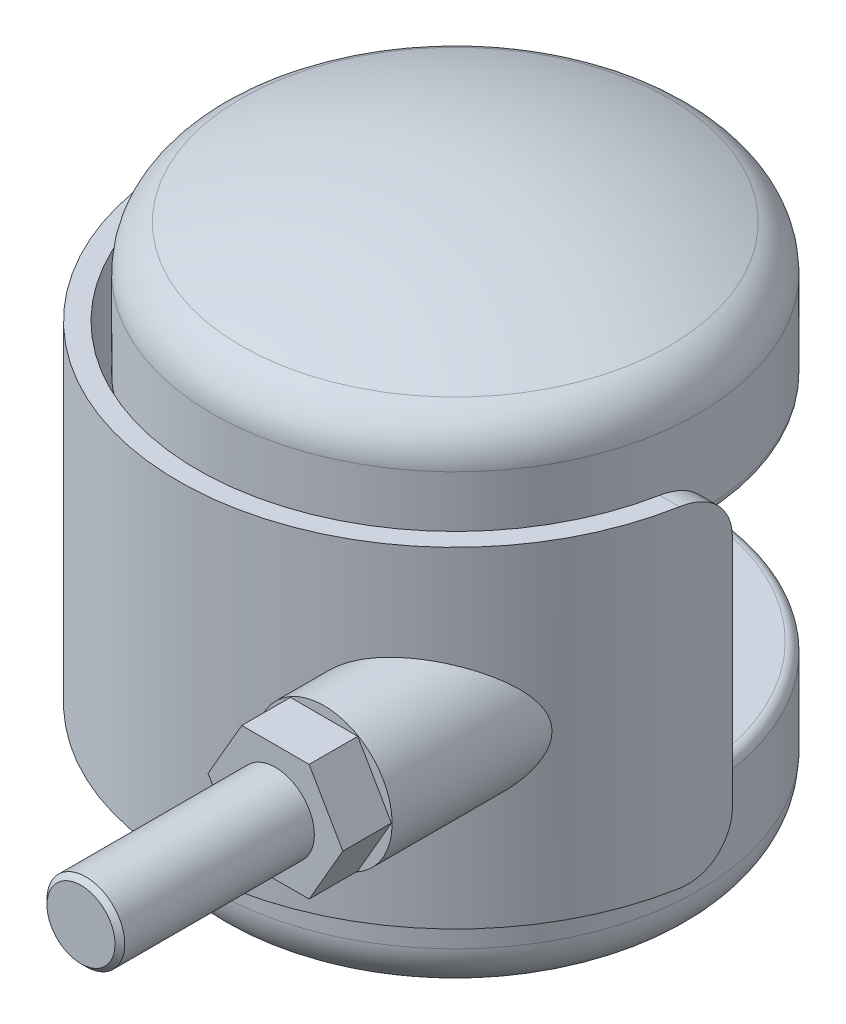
ISO-10303-21;
HEADER;
FILE_DESCRIPTION(('STEP AP214'),'2;1');
FILE_NAME('part.step','',(''),(''),'','','');
FILE_SCHEMA(('AUTOMOTIVE_DESIGN { 1 0 10303 214 1 1 1 1 }'));
ENDSEC;
DATA;
#1=APPLICATION_CONTEXT('core data for automotive mechanical design processes');
#2=APPLICATION_PROTOCOL_DEFINITION('international standard','automotive_design',2000,#1);
#3=PRODUCT_CONTEXT('',#1,'mechanical');
#4=PRODUCT('Part','Part','',(#3));
#5=PRODUCT_RELATED_PRODUCT_CATEGORY('part','',(#4));
#6=PRODUCT_DEFINITION_FORMATION('','',#4);
#7=PRODUCT_DEFINITION_CONTEXT('part definition',#1,'design');
#8=PRODUCT_DEFINITION('design','',#6,#7);
#9=PRODUCT_DEFINITION_SHAPE('','',#8);
#10=(LENGTH_UNIT() NAMED_UNIT(*) SI_UNIT(.MILLI.,.METRE.));
#11=(NAMED_UNIT(*) PLANE_ANGLE_UNIT() SI_UNIT($,.RADIAN.));
#12=(NAMED_UNIT(*) SI_UNIT($,.STERADIAN.) SOLID_ANGLE_UNIT());
#13=UNCERTAINTY_MEASURE_WITH_UNIT(LENGTH_MEASURE(1.E-05),#10,'distance_accuracy_value','');
#14=(GEOMETRIC_REPRESENTATION_CONTEXT(3) GLOBAL_UNCERTAINTY_ASSIGNED_CONTEXT((#13)) GLOBAL_UNIT_ASSIGNED_CONTEXT((#10,
#11,#12)) REPRESENTATION_CONTEXT('',''));
#15=CARTESIAN_POINT('',(0.,0.,0.));
#16=DIRECTION('',(0.,0.,1.));
#17=DIRECTION('',(1.,0.,0.));
#18=AXIS2_PLACEMENT_3D('',#15,#16,#17);
#19=CARTESIAN_POINT('',(340.779513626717,127.578775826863,-36.));
#20=DIRECTION('',(-1.,0.,0.));
#21=DIRECTION('',(0.,-1.,0.));
#22=AXIS2_PLACEMENT_3D('',#19,#20,#21);
#23=SPHERICAL_SURFACE('',#22,54.1557809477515);
#24=CARTESIAN_POINT('',(340.779513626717,177.049333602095,-36.));
#25=DIRECTION('',(0.,-1.,0.));
#26=DIRECTION('',(0.,0.,1.));
#27=AXIS2_PLACEMENT_3D('',#24,#25,#26);
#28=CIRCLE('',#27,22.034348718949);
#29=CARTESIAN_POINT('',(340.779513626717,177.049333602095,-13.965651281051));
#30=VERTEX_POINT('',#29);
#31=EDGE_CURVE('P0_E17',#30,#30,#28,.T.);
#32=ORIENTED_EDGE('',*,*,#31,.F.);
#33=EDGE_LOOP('',(#32));
#34=FACE_BOUND('',#33,.T.);
#35=ADVANCED_FACE('P0_F13',(#34),#23,.T.);
#36=CARTESIAN_POINT('',(340.779513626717,172.481902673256,-36.));
#37=DIRECTION('',(0.,-1.,0.));
#38=DIRECTION('',(0.,0.,1.));
#39=AXIS2_PLACEMENT_3D('',#36,#37,#38);
#40=TOROIDAL_SURFACE('',#39,20.,5.00000000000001);
#41=ORIENTED_EDGE('',*,*,#31,.T.);
#42=EDGE_LOOP('',(#41));
#43=FACE_BOUND('',#42,.T.);
#44=CARTESIAN_POINT('',(340.779513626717,172.481902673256,-36.));
#45=DIRECTION('',(0.,-1.,0.));
#46=DIRECTION('',(0.,0.,-1.));
#47=AXIS2_PLACEMENT_3D('',#44,#45,#46);
#48=CIRCLE('',#47,25.);
#49=CARTESIAN_POINT('',(340.779513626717,172.481902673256,-61.));
#50=VERTEX_POINT('',#49);
#51=EDGE_CURVE('P0_E25',#50,#50,#48,.T.);
#52=ORIENTED_EDGE('',*,*,#51,.F.);
#53=EDGE_LOOP('',(#52));
#54=FACE_BOUND('',#53,.T.);
#55=ADVANCED_FACE('P0_F57',(#43,#54),#40,.T.);
#56=CARTESIAN_POINT('',(340.779513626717,167.608229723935,-36.));
#57=DIRECTION('',(0.,-1.,0.));
#58=DIRECTION('',(0.,0.,-1.));
#59=AXIS2_PLACEMENT_3D('',#56,#57,#58);
#60=CYLINDRICAL_SURFACE('',#59,25.);
#61=CARTESIAN_POINT('',(340.779513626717,163.734556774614,-36.));
#62=DIRECTION('',(0.,-1.,0.));
#63=DIRECTION('',(0.,0.,-1.));
#64=AXIS2_PLACEMENT_3D('',#61,#62,#63);
#65=CIRCLE('',#64,25.);
#66=CARTESIAN_POINT('',(340.779513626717,163.734556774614,-61.));
#67=VERTEX_POINT('',#66);
#68=EDGE_CURVE('P0_E20',#67,#67,#65,.T.);
#69=ORIENTED_EDGE('',*,*,#68,.F.);
#70=EDGE_LOOP('',(#69));
#71=FACE_BOUND('',#70,.T.);
#72=ORIENTED_EDGE('',*,*,#51,.T.);
#73=EDGE_LOOP('',(#72));
#74=FACE_BOUND('',#73,.T.);
#75=ADVANCED_FACE('P0_F54',(#71,#74),#60,.T.);
#76=CARTESIAN_POINT('',(340.779513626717,163.734556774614,-36.));
#77=DIRECTION('',(0.,-1.,0.));
#78=DIRECTION('',(0.,0.,-1.));
#79=AXIS2_PLACEMENT_3D('',#76,#77,#78);
#80=TOROIDAL_SURFACE('',#79,24.,1.);
#81=CARTESIAN_POINT('',(340.779513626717,162.734556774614,-36.));
#82=DIRECTION('',(0.,1.,0.));
#83=DIRECTION('',(-1.,0.,0.));
#84=AXIS2_PLACEMENT_3D('',#81,#82,#83);
#85=CIRCLE('',#84,24.);
#86=CARTESIAN_POINT('',(316.779513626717,162.734556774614,-35.9999999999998));
#87=VERTEX_POINT('',#86);
#88=EDGE_CURVE('P0_E9',#87,#87,#85,.F.);
#89=ORIENTED_EDGE('',*,*,#88,.F.);
#90=EDGE_LOOP('',(#89));
#91=FACE_BOUND('',#90,.T.);
#92=ORIENTED_EDGE('',*,*,#68,.T.);
#93=EDGE_LOOP('',(#92));
#94=FACE_BOUND('',#93,.T.);
#95=ADVANCED_FACE('P0_F43',(#91,#94),#80,.T.);
#96=CARTESIAN_POINT('',(328.279513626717,162.734556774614,-36.));
#97=DIRECTION('',(0.,-1.,0.));
#98=DIRECTION('',(0.,0.,-1.));
#99=AXIS2_PLACEMENT_3D('',#96,#97,#98);
#100=PLANE('',#99);
#101=ORIENTED_EDGE('',*,*,#88,.T.);
#102=EDGE_LOOP('',(#101));
#103=FACE_BOUND('',#102,.T.);
#104=ADVANCED_FACE('P0_F53',(#103),#100,.T.);
#105=CLOSED_SHELL('',(#35,#55,#75,#95,#104));
#106=MANIFOLD_SOLID_BREP('P0_B1',#105);
#107=CARTESIAN_POINT('',(351.351310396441,151.234556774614,-5.));
#108=DIRECTION('',(0.,0.,-1.));
#109=DIRECTION('',(-1.,0.,0.));
#110=AXIS2_PLACEMENT_3D('',#107,#108,#109);
#111=PLANE('',#110);
#112=CARTESIAN_POINT('',(358.279513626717,151.234556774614,-5.));
#113=DIRECTION('',(0.,0.,1.));
#114=DIRECTION('',(1.,0.,0.));
#115=AXIS2_PLACEMENT_3D('',#112,#113,#114);
#116=CIRCLE('',#115,4.5);
#117=CARTESIAN_POINT('',(362.779513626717,151.234556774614,-5.));
#118=VERTEX_POINT('',#117);
#119=EDGE_CURVE('P1_E17',#118,#118,#116,.F.);
#120=ORIENTED_EDGE('',*,*,#119,.F.);
#121=EDGE_LOOP('',(#120));
#122=FACE_BOUND('',#121,.T.);
#123=ADVANCED_FACE('P1_F14',(#122),#111,.F.);
#124=CARTESIAN_POINT('',(340.779513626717,168.234556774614,-36.));
#125=DIRECTION('',(0.,-1.,0.));
#126=DIRECTION('',(0.,0.,-1.));
#127=AXIS2_PLACEMENT_3D('',#124,#125,#126);
#128=CYLINDRICAL_SURFACE('',#127,28.5);
#129=CARTESIAN_POINT('',(353.779513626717,151.234556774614,-10.6376262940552));
#130=CARTESIAN_POINT('',(353.779513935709,151.119408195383,-10.63762637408));
#131=CARTESIAN_POINT('',(353.783938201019,151.004252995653,-10.6398927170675));
#132=CARTESIAN_POINT('',(353.80158617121,150.77475473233,-10.6489502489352));
#133=CARTESIAN_POINT('',(353.814813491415,150.660412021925,-10.6557432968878));
#134=CARTESIAN_POINT('',(353.849935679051,150.433267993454,-10.6738384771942));
#135=CARTESIAN_POINT('',(353.871842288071,150.320468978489,-10.6851467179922));
#136=CARTESIAN_POINT('',(353.92407208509,150.097339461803,-10.7122273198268));
#137=CARTESIAN_POINT('',(353.954398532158,149.987009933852,-10.728001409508));
#138=CARTESIAN_POINT('',(354.02301560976,149.769924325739,-10.7638919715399));
#139=CARTESIAN_POINT('',(354.061284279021,149.663159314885,-10.7839964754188));
#140=CARTESIAN_POINT('',(354.145416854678,149.453544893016,-10.828490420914));
#141=CARTESIAN_POINT('',(354.191283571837,149.350696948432,-10.8528814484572));
#142=CARTESIAN_POINT('',(354.290062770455,149.149654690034,-10.9058134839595));
#143=CARTESIAN_POINT('',(354.342970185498,149.051457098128,-10.9343515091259));
#144=CARTESIAN_POINT('',(354.455316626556,148.860145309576,-10.9954703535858));
#145=CARTESIAN_POINT('',(354.514758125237,148.767033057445,-11.0280527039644));
#146=CARTESIAN_POINT('',(354.641528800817,148.583540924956,-11.0981940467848));
#147=CARTESIAN_POINT('',(354.709047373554,148.493339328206,-11.1358774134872));
#148=CARTESIAN_POINT('',(354.849704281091,148.319261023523,-11.2152008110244));
#149=CARTESIAN_POINT('',(354.922844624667,148.235386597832,-11.256842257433));
#150=CARTESIAN_POINT('',(355.149639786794,147.993785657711,-11.3874057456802));
#151=CARTESIAN_POINT('',(355.310749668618,147.845965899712,-11.4820112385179));
#152=CARTESIAN_POINT('',(355.663673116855,147.565339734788,-11.6944814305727));
#153=CARTESIAN_POINT('',(355.856948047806,147.435438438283,-11.8137184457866));
#154=CARTESIAN_POINT('',(356.25410359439,147.20964079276,-12.0658721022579));
#155=CARTESIAN_POINT('',(356.457989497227,147.113761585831,-12.1987955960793));
#156=CARTESIAN_POINT('',(356.901207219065,146.943328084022,-12.496336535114));
#157=CARTESIAN_POINT('',(357.141338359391,146.873991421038,-12.6627389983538));
#158=CARTESIAN_POINT('',(357.621631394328,146.776155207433,-13.006944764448));
#159=CARTESIAN_POINT('',(357.861793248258,146.747675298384,-13.1847535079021));
#160=CARTESIAN_POINT('',(358.380341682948,146.726915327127,-13.5815761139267));
#161=CARTESIAN_POINT('',(358.657773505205,146.74212570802,-13.8022202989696));
#162=CARTESIAN_POINT('',(359.200325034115,146.821236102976,-14.2503403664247));
#163=CARTESIAN_POINT('',(359.465429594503,146.885194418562,-14.4778241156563));
#164=CARTESIAN_POINT('',(359.871512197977,147.022613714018,-14.8390484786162));
#165=CARTESIAN_POINT('',(360.018176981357,147.081006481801,-14.9723475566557));
#166=CARTESIAN_POINT('',(360.305047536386,147.213095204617,-15.2384551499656));
#167=CARTESIAN_POINT('',(360.445251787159,147.286794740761,-15.3712635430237));
#168=CARTESIAN_POINT('',(360.718285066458,147.449370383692,-15.6350440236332));
#169=CARTESIAN_POINT('',(360.851116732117,147.538241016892,-15.7660167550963));
#170=CARTESIAN_POINT('',(361.10852876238,147.731336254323,-16.0246553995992));
#171=CARTESIAN_POINT('',(361.233112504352,147.83555451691,-16.1523226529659));
#172=CARTESIAN_POINT('',(361.435756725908,148.025047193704,-16.3637088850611));
#173=CARTESIAN_POINT('',(361.516271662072,148.106185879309,-16.4487884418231));
#174=CARTESIAN_POINT('',(361.672364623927,148.276197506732,-16.6156795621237));
#175=CARTESIAN_POINT('',(361.747941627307,148.365072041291,-16.6974904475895));
#176=CARTESIAN_POINT('',(361.966183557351,148.643418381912,-16.9363926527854));
#177=CARTESIAN_POINT('',(362.10077930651,148.844997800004,-17.0873947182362));
#178=CARTESIAN_POINT('',(362.30808019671,149.221293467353,-17.3241197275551));
#179=CARTESIAN_POINT('',(362.387623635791,149.388133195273,-17.4163707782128));
#180=CARTESIAN_POINT('',(362.527870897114,149.73890688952,-17.5807003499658));
#181=CARTESIAN_POINT('',(362.58860318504,149.922814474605,-17.6528093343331));
#182=CARTESIAN_POINT('',(362.678045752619,150.270649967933,-17.7597068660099));
#183=CARTESIAN_POINT('',(362.710547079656,150.432239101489,-17.7988709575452));
#184=CARTESIAN_POINT('',(362.757682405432,150.761682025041,-17.8558135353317));
#185=CARTESIAN_POINT('',(362.772331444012,150.929530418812,-17.8736100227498));
#186=CARTESIAN_POINT('',(362.78257102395,151.267132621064,-17.8860400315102));
#187=CARTESIAN_POINT('',(362.778111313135,151.436890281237,-17.8806124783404));
#188=CARTESIAN_POINT('',(362.750412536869,151.772581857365,-17.847037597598));
#189=CARTESIAN_POINT('',(362.727164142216,151.938513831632,-17.8188789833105));
#190=CARTESIAN_POINT('',(362.664618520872,152.257577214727,-17.7436463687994));
#191=CARTESIAN_POINT('',(362.625796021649,152.410938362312,-17.6971325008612));
#192=CARTESIAN_POINT('',(362.534414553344,152.707636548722,-17.5886085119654));
#193=CARTESIAN_POINT('',(362.481849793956,152.850969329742,-17.5265918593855));
#194=CARTESIAN_POINT('',(362.329519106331,153.210802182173,-17.3487836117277));
#195=CARTESIAN_POINT('',(362.220513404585,153.418638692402,-17.2232574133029));
#196=CARTESIAN_POINT('',(362.040035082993,153.708731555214,-17.0197834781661));
#197=CARTESIAN_POINT('',(361.976910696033,153.801975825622,-16.9492790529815));
#198=CARTESIAN_POINT('',(361.845592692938,153.981449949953,-16.8041709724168));
#199=CARTESIAN_POINT('',(361.777400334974,154.067681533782,-16.7295683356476));
#200=CARTESIAN_POINT('',(361.605818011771,154.269367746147,-16.5439669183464));
#201=CARTESIAN_POINT('',(361.500026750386,154.381205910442,-16.4312595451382));
#202=CARTESIAN_POINT('',(361.280328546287,154.59137420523,-16.2012143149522));
#203=CARTESIAN_POINT('',(361.166418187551,154.689698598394,-16.0838745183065));
#204=CARTESIAN_POINT('',(360.93139909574,154.873201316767,-15.8461054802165));
#205=CARTESIAN_POINT('',(360.810288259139,154.958375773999,-15.7256753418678));
#206=CARTESIAN_POINT('',(360.561659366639,155.115722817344,-15.4830097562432));
#207=CARTESIAN_POINT('',(360.434142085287,155.187896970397,-15.3607745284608));
#208=CARTESIAN_POINT('',(360.170061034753,155.320903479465,-15.1124357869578));
#209=CARTESIAN_POINT('',(360.03335077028,155.381407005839,-14.9863119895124));
#210=CARTESIAN_POINT('',(359.754448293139,155.488601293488,-14.7341302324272));
#211=CARTESIAN_POINT('',(359.612253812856,155.535286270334,-14.6080723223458));
#212=CARTESIAN_POINT('',(359.323052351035,155.614455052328,-14.3568980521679));
#213=CARTESIAN_POINT('',(359.176043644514,155.646933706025,-14.2317820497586));
#214=CARTESIAN_POINT('',(358.878019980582,155.697137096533,-13.9833767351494));
#215=CARTESIAN_POINT('',(358.727005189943,155.714862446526,-13.8600873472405));
#216=CARTESIAN_POINT('',(358.407467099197,155.735847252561,-13.6046676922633));
#217=CARTESIAN_POINT('',(358.238632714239,155.737589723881,-13.4727962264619));
#218=CARTESIAN_POINT('',(357.89855465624,155.721632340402,-13.2132893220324));
#219=CARTESIAN_POINT('',(357.727310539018,155.703928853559,-13.0856546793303));
#220=CARTESIAN_POINT('',(357.384495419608,155.648064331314,-12.8360311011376));
#221=CARTESIAN_POINT('',(357.212925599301,155.609941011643,-12.7140322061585));
#222=CARTESIAN_POINT('',(356.871339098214,155.512238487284,-12.4766852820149));
#223=CARTESIAN_POINT('',(356.701321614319,155.452671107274,-12.3613336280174));
#224=CARTESIAN_POINT('',(356.420414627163,155.33440928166,-12.1749993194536));
#225=CARTESIAN_POINT('',(356.308374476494,155.281802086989,-12.1018450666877));
#226=CARTESIAN_POINT('',(356.087100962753,155.166336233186,-11.9595122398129));
#227=CARTESIAN_POINT('',(355.977866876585,155.103480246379,-11.8903326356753));
#228=CARTESIAN_POINT('',(355.763224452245,154.967441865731,-11.7563530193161));
#229=CARTESIAN_POINT('',(355.657815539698,154.894261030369,-11.691552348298));
#230=CARTESIAN_POINT('',(355.451961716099,154.737650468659,-11.5667491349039));
#231=CARTESIAN_POINT('',(355.351514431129,154.654225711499,-11.5067442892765));
#232=CARTESIAN_POINT('',(355.155981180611,154.476641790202,-11.3914616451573));
#233=CARTESIAN_POINT('',(355.060940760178,154.382407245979,-11.3362224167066));
#234=CARTESIAN_POINT('',(354.878332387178,154.184152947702,-11.2313829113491));
#235=CARTESIAN_POINT('',(354.790760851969,154.080137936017,-11.1817799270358));
#236=CARTESIAN_POINT('',(354.624271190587,153.862852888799,-11.0885207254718));
#237=CARTESIAN_POINT('',(354.545355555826,153.749580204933,-11.0448662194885));
#238=CARTESIAN_POINT('',(354.397437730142,153.514632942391,-10.9638409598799));
#239=CARTESIAN_POINT('',(354.328433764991,153.392959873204,-10.9264690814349));
#240=CARTESIAN_POINT('',(354.209151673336,153.157422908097,-10.8624019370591));
#241=CARTESIAN_POINT('',(354.157618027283,153.044395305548,-10.8349619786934));
#242=CARTESIAN_POINT('',(354.063766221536,152.81348042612,-10.7852928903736));
#243=CARTESIAN_POINT('',(354.021446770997,152.695593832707,-10.7630630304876));
#244=CARTESIAN_POINT('',(353.9466854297,152.45615317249,-10.7239764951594));
#245=CARTESIAN_POINT('',(353.914222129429,152.334607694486,-10.7071081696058));
#246=CARTESIAN_POINT('',(353.859520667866,152.088674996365,-10.6787763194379));
#247=CARTESIAN_POINT('',(353.837277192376,151.96428928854,-10.6673099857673));
#248=CARTESIAN_POINT('',(353.80674178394,151.739034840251,-10.6515966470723));
#249=CARTESIAN_POINT('',(353.796539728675,151.6384885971,-10.6463594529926));
#250=CARTESIAN_POINT('',(353.782925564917,151.436815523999,-10.6393742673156));
#251=CARTESIAN_POINT('',(353.779513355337,151.335688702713,-10.6376262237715));
#252=CARTESIAN_POINT('',(353.779513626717,151.234556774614,-10.6376262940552));
#253=B_SPLINE_CURVE_WITH_KNOTS('',3,(#129,#130,#131,#132,#133,#134,#135,#136,#137,#138,#139,
#140,#141,#142,#143,#144,#145,#146,#147,#148,#149,#150,#151,#152,#153,#154,#155,#156,#157,#158,
#159,#160,#161,#162,#163,#164,#165,#166,#167,#168,#169,#170,#171,#172,#173,#174,#175,#176,#177,
#178,#179,#180,#181,#182,#183,#184,#185,#186,#187,#188,#189,#190,#191,#192,#193,#194,#195,#196,
#197,#198,#199,#200,#201,#202,#203,#204,#205,#206,#207,#208,#209,#210,#211,#212,#213,#214,#215,
#216,#217,#218,#219,#220,#221,#222,#223,#224,#225,#226,#227,#228,#229,#230,#231,#232,#233,#234,
#235,#236,#237,#238,#239,#240,#241,#242,#243,#244,#245,#246,#247,#248,#249,#250,#251,#252),
.UNSPECIFIED.,.T.,.F.,(4,2,2,2,2,2,2,2,2,2,2,2,2,2,2,2,2,2,2,2,2,2,2,2,2,2,2,2,2,2,2,2,2,2,2,2,
2,2,2,2,2,2,2,2,2,2,2,2,2,2,2,2,2,2,2,2,2,2,2,2,2,4),(0.,0.345350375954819,0.690842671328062,
1.03680396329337,1.38289935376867,1.72805020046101,2.07332901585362,2.41836070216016,
2.76352340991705,3.11955164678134,3.47570769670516,4.18758090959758,4.96944631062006,
5.75170509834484,6.64912989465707,7.54698597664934,8.60745516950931,9.66919465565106,
10.2884599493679,10.9078702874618,11.5270576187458,12.1459898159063,12.5731486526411,
13.0003956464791,13.8527459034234,14.4705026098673,15.087319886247,15.5934241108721,
16.099101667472,16.6061098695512,17.1133699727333,17.6062183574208,18.0992747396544,
18.8929086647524,19.2912474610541,19.6894876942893,20.2610607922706,20.8328758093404,
21.4048587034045,21.9767726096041,22.562991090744,23.1494546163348,23.7361306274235,
24.3227822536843,24.9645979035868,25.606533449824,26.2472873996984,26.8876885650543,
27.3186244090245,27.7494480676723,28.1802067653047,28.6107573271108,29.0445172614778,
29.4780679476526,29.9117430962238,30.3453405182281,30.7264769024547,31.1075598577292,
31.4878090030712,31.8678601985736,32.171176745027,32.4744887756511),.UNSPECIFIED.);
#254=CARTESIAN_POINT('',(353.779513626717,151.234556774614,-10.6376262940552));
#255=VERTEX_POINT('',#254);
#256=EDGE_CURVE('P1_E10',#255,#255,#253,.T.);
#257=ORIENTED_EDGE('',*,*,#256,.F.);
#258=EDGE_LOOP('',(#257));
#259=FACE_BOUND('',#258,.T.);
#260=ADVANCED_FACE('P1_F27',(#259),#128,.F.);
#261=CARTESIAN_POINT('',(358.279513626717,151.234556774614,-36.));
#262=DIRECTION('',(0.,0.,1.));
#263=DIRECTION('',(1.,0.,0.));
#264=AXIS2_PLACEMENT_3D('',#261,#262,#263);
#265=CYLINDRICAL_SURFACE('',#264,4.5);
#266=ORIENTED_EDGE('',*,*,#256,.T.);
#267=EDGE_LOOP('',(#266));
#268=FACE_BOUND('',#267,.T.);
#269=ORIENTED_EDGE('',*,*,#119,.T.);
#270=EDGE_LOOP('',(#269));
#271=FACE_BOUND('',#270,.T.);
#272=ADVANCED_FACE('P1_F29',(#268,#271),#265,.T.);
#273=CLOSED_SHELL('',(#123,#260,#272));
#274=MANIFOLD_SOLID_BREP('P1_B1',#273);
#275=CARTESIAN_POINT('',(362.279513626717,151.234556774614,20.));
#276=DIRECTION('',(0.,0.,1.));
#277=DIRECTION('',(1.,0.,0.));
#278=AXIS2_PLACEMENT_3D('',#275,#276,#277);
#279=PLANE('',#278);
#280=CARTESIAN_POINT('',(358.279513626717,151.234556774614,20.0000000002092));
#281=DIRECTION('',(0.,0.,-1.));
#282=DIRECTION('',(-1.,0.,0.));
#283=AXIS2_PLACEMENT_3D('',#280,#281,#282);
#284=CIRCLE('',#283,3.50000000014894);
#285=CARTESIAN_POINT('',(354.779513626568,151.234556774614,20.0000000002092));
#286=VERTEX_POINT('',#285);
#287=EDGE_CURVE('P2_E19',#286,#286,#284,.T.);
#288=ORIENTED_EDGE('',*,*,#287,.F.);
#289=EDGE_LOOP('',(#288));
#290=FACE_BOUND('',#289,.T.);
#291=ADVANCED_FACE('P2_F16',(#290),#279,.T.);
#292=CARTESIAN_POINT('',(340.779513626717,168.234556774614,-36.));
#293=DIRECTION('',(0.,-1.,0.));
#294=DIRECTION('',(0.,0.,-1.));
#295=AXIS2_PLACEMENT_3D('',#292,#293,#294);
#296=CYLINDRICAL_SURFACE('',#295,26.5);
#297=CARTESIAN_POINT('',(353.779513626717,151.234556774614,-12.907793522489));
#298=CARTESIAN_POINT('',(353.779514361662,151.34781832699,-12.9077937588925));
#299=CARTESIAN_POINT('',(353.783795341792,151.461098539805,-12.9102023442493));
#300=CARTESIAN_POINT('',(353.800869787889,151.686855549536,-12.9198271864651));
#301=CARTESIAN_POINT('',(353.813667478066,151.799331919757,-12.9270458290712));
#302=CARTESIAN_POINT('',(353.847642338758,152.022787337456,-12.9462716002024));
#303=CARTESIAN_POINT('',(353.868833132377,152.133763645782,-12.9582865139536));
#304=CARTESIAN_POINT('',(353.919333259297,152.353269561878,-12.9870474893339));
#305=CARTESIAN_POINT('',(353.948645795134,152.461798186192,-13.0037954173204));
#306=CARTESIAN_POINT('',(354.014922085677,152.675288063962,-13.041876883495));
#307=CARTESIAN_POINT('',(354.051861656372,152.780259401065,-13.0631959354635));
#308=CARTESIAN_POINT('',(354.132999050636,152.986328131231,-13.1103379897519));
#309=CARTESIAN_POINT('',(354.177199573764,153.087424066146,-13.1361626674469));
#310=CARTESIAN_POINT('',(354.319882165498,153.383802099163,-13.2201711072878));
#311=CARTESIAN_POINT('',(354.428538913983,153.572471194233,-13.2849422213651));
#312=CARTESIAN_POINT('',(354.672475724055,153.934311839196,-13.4332849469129));
#313=CARTESIAN_POINT('',(354.80857440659,154.106679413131,-13.5174501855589));
#314=CARTESIAN_POINT('',(355.099213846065,154.425520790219,-13.7014405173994));
#315=CARTESIAN_POINT('',(355.253760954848,154.571985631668,-13.8012710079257));
#316=CARTESIAN_POINT('',(355.594161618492,154.852977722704,-14.0267800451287));
#317=CARTESIAN_POINT('',(355.781578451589,154.98427426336,-14.1541055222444));
#318=CARTESIAN_POINT('',(356.166119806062,155.21372309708,-14.4232198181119));
#319=CARTESIAN_POINT('',(356.363251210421,155.311851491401,-14.5650189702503));
#320=CARTESIAN_POINT('',(356.704778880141,155.452844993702,-14.8182280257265));
#321=CARTESIAN_POINT('',(356.848180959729,155.503489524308,-14.9267713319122));
#322=CARTESIAN_POINT('',(357.135628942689,155.589327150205,-15.1490891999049));
#323=CARTESIAN_POINT('',(357.279675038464,155.624515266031,-15.2628654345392));
#324=CARTESIAN_POINT('',(357.567204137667,155.680239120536,-15.4949363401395));
#325=CARTESIAN_POINT('',(357.710686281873,155.700757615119,-15.613236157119));
#326=CARTESIAN_POINT('',(357.995892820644,155.727894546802,-15.8535095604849));
#327=CARTESIAN_POINT('',(358.137616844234,155.73451009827,-15.9754839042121));
#328=CARTESIAN_POINT('',(358.452614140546,155.734614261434,-16.2524553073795));
#329=CARTESIAN_POINT('',(358.625176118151,155.724518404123,-16.4082680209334));
#330=CARTESIAN_POINT('',(358.964992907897,155.68533038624,-16.7232766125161));
#331=CARTESIAN_POINT('',(359.132246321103,155.656233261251,-16.8824733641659));
#332=CARTESIAN_POINT('',(359.460756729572,155.580031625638,-17.2033520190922));
#333=CARTESIAN_POINT('',(359.622001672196,155.532892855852,-17.3650380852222));
#334=CARTESIAN_POINT('',(359.93734330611,155.421389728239,-17.6893823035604));
#335=CARTESIAN_POINT('',(360.091440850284,155.357027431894,-17.8520403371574));
#336=CARTESIAN_POINT('',(360.393485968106,155.210685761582,-18.1788847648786));
#337=CARTESIAN_POINT('',(360.541345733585,155.12851782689,-18.3430679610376));
#338=CARTESIAN_POINT('',(360.828371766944,154.946991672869,-18.669663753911));
#339=CARTESIAN_POINT('',(360.967535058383,154.847627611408,-18.8320757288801));
#340=CARTESIAN_POINT('',(361.235811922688,154.631596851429,-19.1526442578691));
#341=CARTESIAN_POINT('',(361.364955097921,154.514984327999,-19.3108123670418));
#342=CARTESIAN_POINT('',(361.612345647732,154.263310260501,-19.6206735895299));
#343=CARTESIAN_POINT('',(361.730603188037,154.128266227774,-19.7723726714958));
#344=CARTESIAN_POINT('',(361.949591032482,153.844395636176,-20.0592055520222));
#345=CARTESIAN_POINT('',(362.05086283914,153.696434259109,-20.1947741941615));
#346=CARTESIAN_POINT('',(362.239283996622,153.380258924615,-20.4515749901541));
#347=CARTESIAN_POINT('',(362.326445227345,153.212062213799,-20.5728191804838));
#348=CARTESIAN_POINT('',(362.468417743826,152.886414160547,-20.7732563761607));
#349=CARTESIAN_POINT('',(362.52622926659,152.732553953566,-20.8560875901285));
#350=CARTESIAN_POINT('',(362.626378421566,152.410578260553,-21.0009240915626));
#351=CARTESIAN_POINT('',(362.668744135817,152.24248933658,-21.0629671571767));
#352=CARTESIAN_POINT('',(362.727649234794,151.930223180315,-21.1496956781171));
#353=CARTESIAN_POINT('',(362.747686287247,151.788122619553,-21.1794090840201));
#354=CARTESIAN_POINT('',(362.774005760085,151.499916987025,-21.2184946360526));
#355=CARTESIAN_POINT('',(362.780300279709,151.353815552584,-21.2278846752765));
#356=CARTESIAN_POINT('',(362.778567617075,151.061740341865,-21.2253046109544));
#357=CARTESIAN_POINT('',(362.770525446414,150.915766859,-21.2133121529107));
#358=CARTESIAN_POINT('',(362.740836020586,150.628299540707,-21.1692551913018));
#359=CARTESIAN_POINT('',(362.719176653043,150.486809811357,-21.1371728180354));
#360=CARTESIAN_POINT('',(362.65595384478,150.171792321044,-21.0442209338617));
#361=CARTESIAN_POINT('',(362.610460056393,150.000736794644,-20.9777294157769));
#362=CARTESIAN_POINT('',(362.503664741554,149.673684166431,-20.8237031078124));
#363=CARTESIAN_POINT('',(362.442329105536,149.51772056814,-20.7361229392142));
#364=CARTESIAN_POINT('',(362.322571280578,149.25477082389,-20.5677340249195));
#365=CARTESIAN_POINT('',(362.26663346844,149.144690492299,-20.489881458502));
#366=CARTESIAN_POINT('',(362.148419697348,148.933198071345,-20.3274143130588));
#367=CARTESIAN_POINT('',(362.086140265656,148.831790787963,-20.2427960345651));
#368=CARTESIAN_POINT('',(361.95601823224,148.637048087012,-20.0683485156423));
#369=CARTESIAN_POINT('',(361.888166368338,148.54372666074,-19.9785106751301));
#370=CARTESIAN_POINT('',(361.747601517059,148.364834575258,-19.7949800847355));
#371=CARTESIAN_POINT('',(361.67488702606,148.279266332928,-19.701286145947));
#372=CARTESIAN_POINT('',(361.484515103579,148.071131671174,-19.4595137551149));
#373=CARTESIAN_POINT('',(361.363836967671,147.953612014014,-19.3094514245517));
#374=CARTESIAN_POINT('',(361.113284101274,147.734928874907,-19.0050977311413));
#375=CARTESIAN_POINT('',(360.983404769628,147.633773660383,-18.8508042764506));
#376=CARTESIAN_POINT('',(360.715226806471,147.447209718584,-18.5397726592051));
#377=CARTESIAN_POINT('',(360.576921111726,147.361814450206,-18.3830325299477));
#378=CARTESIAN_POINT('',(360.292709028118,147.206748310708,-18.0687396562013));
#379=CARTESIAN_POINT('',(360.146803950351,147.137074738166,-17.9111870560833));
#380=CARTESIAN_POINT('',(359.844160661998,147.012073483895,-17.5924265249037));
#381=CARTESIAN_POINT('',(359.687240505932,146.957159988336,-17.431228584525));
#382=CARTESIAN_POINT('',(359.366743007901,146.86468848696,-17.1104178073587));
#383=CARTESIAN_POINT('',(359.203164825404,146.827132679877,-16.9508051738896));
#384=CARTESIAN_POINT('',(358.87044421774,146.770338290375,-16.6345450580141));
#385=CARTESIAN_POINT('',(358.701309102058,146.751076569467,-16.4778940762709));
#386=CARTESIAN_POINT('',(358.358398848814,146.731974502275,-16.168558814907));
#387=CARTESIAN_POINT('',(358.18462513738,146.73212825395,-16.0158733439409));
#388=CARTESIAN_POINT('',(357.874446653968,146.750790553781,-15.7504373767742));
#389=CARTESIAN_POINT('',(357.738693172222,146.765046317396,-15.6366170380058));
#390=CARTESIAN_POINT('',(357.466130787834,146.80653198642,-15.4126764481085));
#391=CARTESIAN_POINT('',(357.329322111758,146.83375917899,-15.3025554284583));
#392=CARTESIAN_POINT('',(357.055784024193,146.901851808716,-15.0867663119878));
#393=CARTESIAN_POINT('',(356.919054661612,146.942704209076,-14.9810940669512));
#394=CARTESIAN_POINT('',(356.646794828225,147.038719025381,-14.7748136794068));
#395=CARTESIAN_POINT('',(356.511264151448,147.09387893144,-14.6742046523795));
#396=CARTESIAN_POINT('',(356.267519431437,147.207585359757,-14.496742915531));
#397=CARTESIAN_POINT('',(356.158854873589,147.263654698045,-14.4189177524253));
#398=CARTESIAN_POINT('',(355.944266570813,147.385938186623,-14.2675934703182));
#399=CARTESIAN_POINT('',(355.838342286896,147.452150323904,-14.1940934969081));
#400=CARTESIAN_POINT('',(355.630243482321,147.59487419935,-14.0518402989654));
#401=CARTESIAN_POINT('',(355.528069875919,147.671388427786,-13.9830882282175));
#402=CARTESIAN_POINT('',(355.328705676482,147.834656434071,-13.8508394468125));
#403=CARTESIAN_POINT('',(355.231512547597,147.921404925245,-13.7873400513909));
#404=CARTESIAN_POINT('',(355.04249492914,148.105773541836,-13.6654949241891));
#405=CARTESIAN_POINT('',(354.950722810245,148.203479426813,-13.6071973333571));
#406=CARTESIAN_POINT('',(354.774820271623,148.408715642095,-13.4968408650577));
#407=CARTESIAN_POINT('',(354.690685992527,148.516240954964,-13.4447788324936));
#408=CARTESIAN_POINT('',(354.531332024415,148.740551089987,-13.3472689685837));
#409=CARTESIAN_POINT('',(354.456113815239,148.857337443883,-13.3018222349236));
#410=CARTESIAN_POINT('',(354.315920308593,149.099267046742,-13.217937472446));
#411=CARTESIAN_POINT('',(354.250942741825,149.224408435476,-13.1794978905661));
#412=CARTESIAN_POINT('',(354.140699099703,149.463937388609,-13.1148034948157));
#413=CARTESIAN_POINT('',(354.093947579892,149.577387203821,-13.0875967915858));
#414=CARTESIAN_POINT('',(354.009578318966,149.80878994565,-13.0387768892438));
#415=CARTESIAN_POINT('',(353.971959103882,149.926742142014,-13.0171627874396));
#416=CARTESIAN_POINT('',(353.906494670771,150.165894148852,-12.9797091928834));
#417=CARTESIAN_POINT('',(353.878625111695,150.287085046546,-12.9638553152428));
#418=CARTESIAN_POINT('',(353.832968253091,150.531903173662,-12.9379529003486));
#419=CARTESIAN_POINT('',(353.81517472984,150.655528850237,-12.927900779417));
#420=CARTESIAN_POINT('',(353.794883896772,150.855273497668,-12.9164516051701));
#421=CARTESIAN_POINT('',(353.789123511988,150.930974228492,-12.9132057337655));
#422=CARTESIAN_POINT('',(353.781438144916,151.082632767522,-12.9088766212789));
#423=CARTESIAN_POINT('',(353.779513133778,151.158590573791,-12.9077933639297));
#424=CARTESIAN_POINT('',(353.779513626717,151.234556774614,-12.907793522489));
#425=B_SPLINE_CURVE_WITH_KNOTS('',3,(#297,#298,#299,#300,#301,#302,#303,#304,#305,#306,#307,
#308,#309,#310,#311,#312,#313,#314,#315,#316,#317,#318,#319,#320,#321,#322,#323,#324,#325,#326,
#327,#328,#329,#330,#331,#332,#333,#334,#335,#336,#337,#338,#339,#340,#341,#342,#343,#344,#345,
#346,#347,#348,#349,#350,#351,#352,#353,#354,#355,#356,#357,#358,#359,#360,#361,#362,#363,#364,
#365,#366,#367,#368,#369,#370,#371,#372,#373,#374,#375,#376,#377,#378,#379,#380,#381,#382,#383,
#384,#385,#386,#387,#388,#389,#390,#391,#392,#393,#394,#395,#396,#397,#398,#399,#400,#401,#402,
#403,#404,#405,#406,#407,#408,#409,#410,#411,#412,#413,#414,#415,#416,#417,#418,#419,#420,#421,
#422,#423,#424),.UNSPECIFIED.,.T.,.F.,(4,2,2,2,2,2,2,2,2,2,2,2,2,2,2,2,2,2,2,2,2,2,2,2,2,2,2,2,
2,2,2,2,2,2,2,2,2,2,2,2,2,2,2,2,2,2,2,2,2,2,2,2,2,2,2,2,2,2,2,2,2,2,2,4),(0.,0.339710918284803,
0.67959045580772,1.02002393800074,1.36059185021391,1.70009602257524,2.03972670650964,
2.7180524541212,3.420834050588,4.12385831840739,4.90650448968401,5.68971338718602,
6.24955414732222,6.80957513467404,7.37025334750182,7.93104792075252,8.62825217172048,
9.32563865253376,10.0243560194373,10.7229897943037,11.4294190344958,12.1360887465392,
12.8405842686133,13.5444150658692,14.217351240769,14.8897178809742,15.4400414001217,
15.9893593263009,16.4271165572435,16.8644882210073,17.3023174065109,17.7405365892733,
18.3046384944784,18.8699652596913,19.3072997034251,19.7448749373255,20.1831928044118,
20.6216468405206,21.2974509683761,21.9735954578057,22.6503147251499,23.3269176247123,
24.0208895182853,24.7149492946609,25.4081300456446,26.1011000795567,26.6338202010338,
27.1664289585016,27.6985295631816,28.230536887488,28.6649573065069,29.0992916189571,
29.5337311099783,29.967947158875,30.4058364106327,30.8435031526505,31.2812424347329,
31.7188845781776,32.0954281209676,32.4719108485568,32.8474468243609,33.2227505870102,
33.4506014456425,33.6784505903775),.UNSPECIFIED.);
#426=CARTESIAN_POINT('',(353.779513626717,151.234556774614,-12.907793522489));
#427=VERTEX_POINT('',#426);
#428=EDGE_CURVE('P2_E173',#427,#427,#425,.T.);
#429=ORIENTED_EDGE('',*,*,#428,.T.);
#430=EDGE_LOOP('',(#429));
#431=FACE_BOUND('',#430,.T.);
#432=ADVANCED_FACE('P2_F328',(#431),#296,.F.);
#433=CARTESIAN_POINT('',(358.279513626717,151.234556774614,19.4999999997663));
#434=DIRECTION('',(0.,0.,-1.));
#435=DIRECTION('',(-1.,0.,0.));
#436=AXIS2_PLACEMENT_3D('',#433,#434,#435);
#437=CONICAL_SURFACE('',#436,3.99999999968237,0.785398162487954);
#438=CARTESIAN_POINT('',(358.279513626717,151.234556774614,19.5));
#439=DIRECTION('',(0.,0.,1.));
#440=DIRECTION('',(1.,0.,0.));
#441=AXIS2_PLACEMENT_3D('',#438,#439,#440);
#442=CIRCLE('',#441,4.);
#443=CARTESIAN_POINT('',(362.279513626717,151.234556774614,19.5));
#444=VERTEX_POINT('',#443);
#445=EDGE_CURVE('P2_E169',#444,#444,#442,.F.);
#446=ORIENTED_EDGE('',*,*,#445,.F.);
#447=EDGE_LOOP('',(#446));
#448=FACE_BOUND('',#447,.T.);
#449=ORIENTED_EDGE('',*,*,#287,.T.);
#450=EDGE_LOOP('',(#449));
#451=FACE_BOUND('',#450,.T.);
#452=ADVANCED_FACE('P2_F322',(#448,#451),#437,.T.);
#453=CARTESIAN_POINT('',(358.279513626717,151.234556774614,-36.));
#454=DIRECTION('',(0.,0.,1.));
#455=DIRECTION('',(1.,0.,0.));
#456=AXIS2_PLACEMENT_3D('',#453,#454,#455);
#457=CYLINDRICAL_SURFACE('',#456,4.5);
#458=ORIENTED_EDGE('',*,*,#428,.F.);
#459=EDGE_LOOP('',(#458));
#460=FACE_BOUND('',#459,.T.);
#461=CARTESIAN_POINT('',(358.279513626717,151.234556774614,-36.));
#462=DIRECTION('',(0.,0.,1.));
#463=DIRECTION('',(1.,0.,0.));
#464=AXIS2_PLACEMENT_3D('',#461,#462,#463);
#465=CIRCLE('',#464,4.5);
#466=CARTESIAN_POINT('',(362.779513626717,151.234556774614,-36.));
#467=VERTEX_POINT('',#466);
#468=EDGE_CURVE('P2_E172',#467,#467,#465,.F.);
#469=ORIENTED_EDGE('',*,*,#468,.T.);
#470=EDGE_LOOP('',(#469));
#471=FACE_BOUND('',#470,.T.);
#472=ADVANCED_FACE('P2_F317',(#460,#471),#457,.F.);
#473=CARTESIAN_POINT('',(358.279513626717,151.234556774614,0.));
#474=DIRECTION('',(0.,0.,1.));
#475=DIRECTION('',(1.,0.,0.));
#476=AXIS2_PLACEMENT_3D('',#473,#474,#475);
#477=CYLINDRICAL_SURFACE('',#476,4.);
#478=ORIENTED_EDGE('',*,*,#445,.T.);
#479=EDGE_LOOP('',(#478));
#480=FACE_BOUND('',#479,.T.);
#481=CARTESIAN_POINT('',(358.279513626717,151.234556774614,0.));
#482=DIRECTION('',(0.,0.,1.));
#483=DIRECTION('',(1.,0.,0.));
#484=AXIS2_PLACEMENT_3D('',#481,#482,#483);
#485=CIRCLE('',#484,4.);
#486=CARTESIAN_POINT('',(362.279513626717,151.234556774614,0.));
#487=VERTEX_POINT('',#486);
#488=EDGE_CURVE('P2_E343',#487,#487,#485,.T.);
#489=ORIENTED_EDGE('',*,*,#488,.T.);
#490=EDGE_LOOP('',(#489));
#491=FACE_BOUND('',#490,.T.);
#492=ADVANCED_FACE('P2_F313',(#480,#491),#477,.T.);
#493=CARTESIAN_POINT('',(358.279513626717,151.234556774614,-36.));
#494=DIRECTION('',(0.,0.,1.));
#495=DIRECTION('',(1.,0.,0.));
#496=AXIS2_PLACEMENT_3D('',#493,#494,#495);
#497=PLANE('',#496);
#498=ORIENTED_EDGE('',*,*,#468,.F.);
#499=EDGE_LOOP('',(#498));
#500=FACE_BOUND('',#499,.T.);
#501=CARTESIAN_POINT('',(358.279513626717,151.234556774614,-36.));
#502=DIRECTION('',(0.,0.,1.));
#503=DIRECTION('',(1.,0.,0.));
#504=AXIS2_PLACEMENT_3D('',#501,#502,#503);
#505=CIRCLE('',#504,7.);
#506=CARTESIAN_POINT('',(365.279513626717,151.234556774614,-36.));
#507=VERTEX_POINT('',#506);
#508=EDGE_CURVE('P2_E178',#507,#507,#505,.T.);
#509=ORIENTED_EDGE('',*,*,#508,.F.);
#510=EDGE_LOOP('',(#509));
#511=FACE_BOUND('',#510,.T.);
#512=ADVANCED_FACE('P2_F309',(#500,#511),#497,.F.);
#513=CARTESIAN_POINT('',(358.279513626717,151.234556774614,0.));
#514=DIRECTION('',(0.,0.,-1.));
#515=DIRECTION('',(-1.,0.,0.));
#516=AXIS2_PLACEMENT_3D('',#513,#514,#515);
#517=PLANE('',#516);
#518=ORIENTED_EDGE('',*,*,#488,.F.);
#519=EDGE_LOOP('',(#518));
#520=FACE_BOUND('',#519,.T.);
#521=DIRECTION('',(0.5,-0.866025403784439,0.));
#522=VECTOR('',#521,1.);
#523=CARTESIAN_POINT('',(351.351310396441,151.234556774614,0.));
#524=LINE('',#523,#522);
#525=CARTESIAN_POINT('',(354.815412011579,145.234556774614,0.));
#526=VERTEX_POINT('',#525);
#527=CARTESIAN_POINT('',(351.351310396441,151.234556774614,0.));
#528=VERTEX_POINT('',#527);
#529=EDGE_CURVE('P2_E174',#526,#528,#524,.F.);
#530=ORIENTED_EDGE('',*,*,#529,.F.);
#531=DIRECTION('',(1.,0.,0.));
#532=VECTOR('',#531,1.);
#533=CARTESIAN_POINT('',(354.815412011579,145.234556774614,0.));
#534=LINE('',#533,#532);
#535=CARTESIAN_POINT('',(361.743615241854,145.234556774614,0.));
#536=VERTEX_POINT('',#535);
#537=EDGE_CURVE('P2_E205',#536,#526,#534,.F.);
#538=ORIENTED_EDGE('',*,*,#537,.F.);
#539=DIRECTION('',(0.500000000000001,0.866025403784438,0.));
#540=VECTOR('',#539,1.);
#541=CARTESIAN_POINT('',(361.743615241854,145.234556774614,0.));
#542=LINE('',#541,#540);
#543=CARTESIAN_POINT('',(365.207716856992,151.234556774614,0.));
#544=VERTEX_POINT('',#543);
#545=EDGE_CURVE('P2_E199',#544,#536,#542,.F.);
#546=ORIENTED_EDGE('',*,*,#545,.F.);
#547=DIRECTION('',(-0.499999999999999,0.866025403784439,0.));
#548=VECTOR('',#547,1.);
#549=CARTESIAN_POINT('',(365.207716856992,151.234556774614,0.));
#550=LINE('',#549,#548);
#551=CARTESIAN_POINT('',(361.743615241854,157.234556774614,0.));
#552=VERTEX_POINT('',#551);
#553=EDGE_CURVE('P2_E193',#552,#544,#550,.F.);
#554=ORIENTED_EDGE('',*,*,#553,.F.);
#555=DIRECTION('',(1.,0.,0.));
#556=VECTOR('',#555,1.);
#557=CARTESIAN_POINT('',(361.743615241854,157.234556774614,0.));
#558=LINE('',#557,#556);
#559=CARTESIAN_POINT('',(354.815412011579,157.234556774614,0.));
#560=VERTEX_POINT('',#559);
#561=EDGE_CURVE('P2_E187',#560,#552,#558,.T.);
#562=ORIENTED_EDGE('',*,*,#561,.F.);
#563=DIRECTION('',(-0.5,-0.866025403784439,0.));
#564=VECTOR('',#563,1.);
#565=CARTESIAN_POINT('',(354.815412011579,157.234556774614,0.));
#566=LINE('',#565,#564);
#567=EDGE_CURVE('P2_E181',#528,#560,#566,.F.);
#568=ORIENTED_EDGE('',*,*,#567,.F.);
#569=EDGE_LOOP('',(#530,#538,#546,#554,#562,#568));
#570=FACE_BOUND('',#569,.T.);
#571=ADVANCED_FACE('P2_F304',(#520,#570),#517,.F.);
#572=CARTESIAN_POINT('',(358.279513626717,151.234556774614,-36.));
#573=DIRECTION('',(0.,0.,1.));
#574=DIRECTION('',(1.,0.,0.));
#575=AXIS2_PLACEMENT_3D('',#572,#573,#574);
#576=CYLINDRICAL_SURFACE('',#575,7.);
#577=CARTESIAN_POINT('',(351.279513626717,151.234556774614,-11.6689498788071));
#578=CARTESIAN_POINT('',(351.279514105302,151.416918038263,-11.6689498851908));
#579=CARTESIAN_POINT('',(351.286646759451,151.599289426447,-11.6720243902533));
#580=CARTESIAN_POINT('',(351.315108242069,151.962779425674,-11.6843366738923));
#581=CARTESIAN_POINT('',(351.336442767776,152.143897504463,-11.69357692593));
#582=CARTESIAN_POINT('',(351.393128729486,152.503782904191,-11.7182757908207));
#583=CARTESIAN_POINT('',(351.428501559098,152.682546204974,-11.7337438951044));
#584=CARTESIAN_POINT('',(351.512885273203,153.036162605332,-11.7709501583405));
#585=CARTESIAN_POINT('',(351.561896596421,153.211015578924,-11.7926885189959));
#586=CARTESIAN_POINT('',(351.672947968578,153.555324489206,-11.8424591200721));
#587=CARTESIAN_POINT('',(351.73496893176,153.724787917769,-11.8704821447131));
#588=CARTESIAN_POINT('',(351.871417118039,154.057430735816,-11.9329000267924));
#589=CARTESIAN_POINT('',(351.945844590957,154.220609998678,-11.9672950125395));
#590=CARTESIAN_POINT('',(352.106269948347,154.539539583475,-12.0424869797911));
#591=CARTESIAN_POINT('',(352.192262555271,154.695293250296,-12.0832810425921));
#592=CARTESIAN_POINT('',(352.374930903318,154.998494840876,-12.1713077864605));
#593=CARTESIAN_POINT('',(352.471606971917,155.145942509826,-12.2185406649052));
#594=CARTESIAN_POINT('',(352.676211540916,155.433924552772,-12.3202232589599));
#595=CARTESIAN_POINT('',(352.784292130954,155.574315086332,-12.3747741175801));
#596=CARTESIAN_POINT('',(353.009279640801,155.844936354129,-12.4904526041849));
#597=CARTESIAN_POINT('',(353.126186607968,155.975167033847,-12.5515802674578));
#598=CARTESIAN_POINT('',(353.367628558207,156.224902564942,-12.6803071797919));
#599=CARTESIAN_POINT('',(353.492163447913,156.344407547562,-12.747906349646));
#600=CARTESIAN_POINT('',(353.747684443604,156.572332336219,-12.8894421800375));
#601=CARTESIAN_POINT('',(353.878672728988,156.680748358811,-12.9633809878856));
#602=CARTESIAN_POINT('',(354.154384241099,156.892776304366,-13.122287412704));
#603=CARTESIAN_POINT('',(354.299450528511,156.995640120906,-13.2076577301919));
#604=CARTESIAN_POINT('',(354.594119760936,157.188453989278,-13.3850437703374));
#605=CARTESIAN_POINT('',(354.743724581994,157.278398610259,-13.4770622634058));
#606=CARTESIAN_POINT('',(355.046094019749,157.445420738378,-13.6673648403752));
#607=CARTESIAN_POINT('',(355.198858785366,157.522497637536,-13.7656492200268));
#608=CARTESIAN_POINT('',(355.506333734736,157.664029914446,-13.9680989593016));
#609=CARTESIAN_POINT('',(355.661044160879,157.728483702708,-14.0722650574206));
#610=CARTESIAN_POINT('',(355.991518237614,157.852726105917,-14.2999944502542));
#611=CARTESIAN_POINT('',(356.167398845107,157.910813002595,-14.4243168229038));
#612=CARTESIAN_POINT('',(356.518836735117,158.011979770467,-14.6793324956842));
#613=CARTESIAN_POINT('',(356.694393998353,158.055058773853,-14.8100261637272));
#614=CARTESIAN_POINT('',(357.044052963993,158.126980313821,-15.0772091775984));
#615=CARTESIAN_POINT('',(357.218154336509,158.155819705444,-15.2136997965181));
#616=CARTESIAN_POINT('',(357.563912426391,158.200064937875,-15.4918738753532));
#617=CARTESIAN_POINT('',(357.735568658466,158.215468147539,-15.6335583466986));
#618=CARTESIAN_POINT('',(358.167250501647,158.238558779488,-15.9991496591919));
#619=CARTESIAN_POINT('',(358.425075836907,158.237622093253,-16.2262400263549));
#620=CARTESIAN_POINT('',(358.930897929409,158.208790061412,-16.6895096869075));
#621=CARTESIAN_POINT('',(359.178890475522,158.18088329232,-16.9256927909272));
#622=CARTESIAN_POINT('',(359.664274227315,158.100641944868,-17.4061098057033));
#623=CARTESIAN_POINT('',(359.901631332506,158.048234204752,-17.6503657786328));
#624=CARTESIAN_POINT('',(360.363975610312,157.921296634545,-18.1446526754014));
#625=CARTESIAN_POINT('',(360.588963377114,157.846767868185,-18.3946833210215));
#626=CARTESIAN_POINT('',(361.087515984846,157.65369426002,-18.9700919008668));
#627=CARTESIAN_POINT('',(361.356949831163,157.528665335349,-19.2968864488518));
#628=CARTESIAN_POINT('',(361.874029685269,157.248374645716,-19.9548556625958));
#629=CARTESIAN_POINT('',(362.12166527,157.093098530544,-20.2860323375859));
#630=CARTESIAN_POINT('',(362.594038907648,156.754442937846,-20.9487073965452));
#631=CARTESIAN_POINT('',(362.818841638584,156.571146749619,-21.2802020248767));
#632=CARTESIAN_POINT('',(363.139066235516,156.274975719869,-21.775404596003));
#633=CARTESIAN_POINT('',(363.242958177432,156.172737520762,-21.940098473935));
#634=CARTESIAN_POINT('',(363.445054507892,155.960932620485,-22.2682719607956));
#635=CARTESIAN_POINT('',(363.543259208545,155.851366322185,-22.4317516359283));
#636=CARTESIAN_POINT('',(363.721583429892,155.639159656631,-22.7358234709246));
#637=CARTESIAN_POINT('',(363.802403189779,155.537444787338,-22.8766515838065));
#638=CARTESIAN_POINT('',(363.959514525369,155.327813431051,-23.1561977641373));
#639=CARTESIAN_POINT('',(364.035806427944,155.219897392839,-23.2949159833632));
#640=CARTESIAN_POINT('',(364.183961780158,154.996933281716,-23.5699441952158));
#641=CARTESIAN_POINT('',(364.255808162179,154.881860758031,-23.7062436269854));
#642=CARTESIAN_POINT('',(364.394488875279,154.644248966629,-23.9747862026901));
#643=CARTESIAN_POINT('',(364.461324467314,154.521711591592,-24.1070303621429));
#644=CARTESIAN_POINT('',(364.590590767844,154.266243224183,-24.3679702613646));
#645=CARTESIAN_POINT('',(364.652937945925,154.133181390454,-24.4965801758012));
#646=CARTESIAN_POINT('',(364.771472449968,153.856975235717,-24.7458914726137));
#647=CARTESIAN_POINT('',(364.82765533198,153.713823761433,-24.8665871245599));
#648=CARTESIAN_POINT('',(364.932452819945,153.416991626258,-25.0958131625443));
#649=CARTESIAN_POINT('',(364.98111479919,153.263386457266,-25.2044183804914));
#650=CARTESIAN_POINT('',(365.069690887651,152.943629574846,-25.4052234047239));
#651=CARTESIAN_POINT('',(365.109623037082,152.777504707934,-25.4974569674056));
#652=CARTESIAN_POINT('',(365.173616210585,152.456868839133,-25.6470567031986));
#653=CARTESIAN_POINT('',(365.199134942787,152.30413268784,-25.7075317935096));
#654=CARTESIAN_POINT('',(365.240388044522,151.990313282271,-25.8059571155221));
#655=CARTESIAN_POINT('',(365.256137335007,151.829243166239,-25.8439416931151));
#656=CARTESIAN_POINT('',(365.276394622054,151.500780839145,-25.8928937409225));
#657=CARTESIAN_POINT('',(365.280806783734,151.333346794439,-25.9036308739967));
#658=CARTESIAN_POINT('',(365.277554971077,150.999261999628,-25.895744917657));
#659=CARTESIAN_POINT('',(365.269885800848,150.832611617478,-25.8771091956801));
#660=CARTESIAN_POINT('',(365.24187606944,150.486911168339,-25.8096001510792));
#661=CARTESIAN_POINT('',(365.220188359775,150.308618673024,-25.7575165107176));
#662=CARTESIAN_POINT('',(365.16537665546,149.963484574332,-25.6277021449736));
#663=CARTESIAN_POINT('',(365.132228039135,149.796668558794,-25.5499162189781));
#664=CARTESIAN_POINT('',(365.063297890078,149.502793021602,-25.3908518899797));
#665=CARTESIAN_POINT('',(365.028928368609,149.373803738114,-25.3124290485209));
#666=CARTESIAN_POINT('',(364.95492154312,149.123643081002,-25.1460633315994));
#667=CARTESIAN_POINT('',(364.915280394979,149.002477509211,-25.0581135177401));
#668=CARTESIAN_POINT('',(364.831391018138,148.767057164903,-24.8749213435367));
#669=CARTESIAN_POINT('',(364.787132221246,148.65281923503,-24.7796623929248));
#670=CARTESIAN_POINT('',(364.694585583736,148.430751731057,-24.5837360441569));
#671=CARTESIAN_POINT('',(364.646296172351,148.322924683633,-24.4830665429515));
#672=CARTESIAN_POINT('',(364.543895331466,148.108497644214,-24.273176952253));
#673=CARTESIAN_POINT('',(364.489622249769,148.002153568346,-24.163775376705));
#674=CARTESIAN_POINT('',(364.377385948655,147.795108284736,-23.9415612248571));
#675=CARTESIAN_POINT('',(364.319421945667,147.694408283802,-23.8287479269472));
#676=CARTESIAN_POINT('',(364.140227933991,147.399848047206,-23.4862753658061));
#677=CARTESIAN_POINT('',(364.01376224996,147.213663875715,-23.2527204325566));
#678=CARTESIAN_POINT('',(363.747760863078,146.858778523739,-22.7794268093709));
#679=CARTESIAN_POINT('',(363.608208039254,146.690100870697,-22.5396803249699));
#680=CARTESIAN_POINT('',(363.316687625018,146.368976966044,-22.057071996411));
#681=CARTESIAN_POINT('',(363.164724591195,146.216524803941,-21.8142113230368));
#682=CARTESIAN_POINT('',(362.829313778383,145.909414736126,-21.2975377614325));
#683=CARTESIAN_POINT('',(362.644286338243,145.756754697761,-21.0235617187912));
#684=CARTESIAN_POINT('',(362.259046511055,145.470803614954,-20.4760911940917));
#685=CARTESIAN_POINT('',(362.058831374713,145.337516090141,-20.202596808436));
#686=CARTESIAN_POINT('',(361.643634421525,145.091195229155,-19.6581656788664));
#687=CARTESIAN_POINT('',(361.428667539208,144.978141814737,-19.3872266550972));
#688=CARTESIAN_POINT('',(360.98409272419,144.773510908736,-18.8492945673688));
#689=CARTESIAN_POINT('',(360.754486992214,144.681930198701,-18.5823009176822));
#690=CARTESIAN_POINT('',(360.30529079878,144.530339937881,-18.080862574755));
#691=CARTESIAN_POINT('',(360.087070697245,144.468061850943,-17.8458775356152));
#692=CARTESIAN_POINT('',(359.639797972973,144.364161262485,-17.3816343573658));
#693=CARTESIAN_POINT('',(359.410744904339,144.322539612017,-17.1523764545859));
#694=CARTESIAN_POINT('',(358.942930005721,144.26207755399,-16.7011439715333));
#695=CARTESIAN_POINT('',(358.704175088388,144.243221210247,-16.479164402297));
#696=CARTESIAN_POINT('',(358.218244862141,144.230609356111,-16.0438745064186));
#697=CARTESIAN_POINT('',(357.971071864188,144.236847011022,-15.8305618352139));
#698=CARTESIAN_POINT('',(357.526594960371,144.272442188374,-15.4610354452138));
#699=CARTESIAN_POINT('',(357.330558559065,144.296292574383,-15.3027575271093));
#700=CARTESIAN_POINT('',(356.935922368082,144.361802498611,-14.9932561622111));
#701=CARTESIAN_POINT('',(356.737323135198,144.403458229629,-14.8420312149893));
#702=CARTESIAN_POINT('',(356.339293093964,144.505684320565,-14.5476227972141));
#703=CARTESIAN_POINT('',(356.139863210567,144.566237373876,-14.4044321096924));
#704=CARTESIAN_POINT('',(355.741924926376,144.707292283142,-14.1268415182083));
#705=CARTESIAN_POINT('',(355.543416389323,144.787791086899,-13.9924402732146));
#706=CARTESIAN_POINT('',(355.181312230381,144.954886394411,-13.7541611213));
#707=CARTESIAN_POINT('',(355.017239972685,145.038415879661,-13.6488522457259));
#708=CARTESIAN_POINT('',(354.69288880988,145.220350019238,-13.4455191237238));
#709=CARTESIAN_POINT('',(354.532609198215,145.318751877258,-13.3474935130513));
#710=CARTESIAN_POINT('',(354.217502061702,145.530515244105,-13.1591558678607));
#711=CARTESIAN_POINT('',(354.062673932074,145.643875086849,-13.0688429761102));
#712=CARTESIAN_POINT('',(353.760215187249,145.885408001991,-12.8962837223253));
#713=CARTESIAN_POINT('',(353.612584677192,146.013581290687,-12.814037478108));
#714=CARTESIAN_POINT('',(353.325597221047,146.285019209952,-12.6574926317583));
#715=CARTESIAN_POINT('',(353.186287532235,146.428359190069,-12.5832377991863));
#716=CARTESIAN_POINT('',(352.918626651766,146.728852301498,-12.443371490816));
#717=CARTESIAN_POINT('',(352.790275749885,146.88600579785,-12.3777602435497));
#718=CARTESIAN_POINT('',(352.546288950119,147.213141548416,-12.2552817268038));
#719=CARTESIAN_POINT('',(352.430655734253,147.383126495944,-12.1984163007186));
#720=CARTESIAN_POINT('',(352.213796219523,147.734599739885,-12.093479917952));
#721=CARTESIAN_POINT('',(352.112568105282,147.916086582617,-12.0454078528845));
#722=CARTESIAN_POINT('',(351.935084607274,148.270836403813,-11.9622820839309));
#723=CARTESIAN_POINT('',(351.857356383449,148.443174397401,-11.9264158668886));
#724=CARTESIAN_POINT('',(351.715741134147,148.794722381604,-11.8617524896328));
#725=CARTESIAN_POINT('',(351.651853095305,148.973931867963,-11.8329548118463));
#726=CARTESIAN_POINT('',(351.538786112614,149.33751392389,-11.7824054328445));
#727=CARTESIAN_POINT('',(351.489579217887,149.521875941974,-11.7606403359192));
#728=CARTESIAN_POINT('',(351.406310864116,149.894585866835,-11.7240189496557));
#729=CARTESIAN_POINT('',(351.372242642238,150.082931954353,-11.709159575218));
#730=CARTESIAN_POINT('',(351.323853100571,150.431681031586,-11.6881207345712));
#731=CARTESIAN_POINT('',(351.30723802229,150.591709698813,-11.6809300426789));
#732=CARTESIAN_POINT('',(351.285068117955,150.912675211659,-11.6713446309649));
#733=CARTESIAN_POINT('',(351.279513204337,151.073612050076,-11.6689498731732));
#734=CARTESIAN_POINT('',(351.279513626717,151.234556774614,-11.6689498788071));
#735=B_SPLINE_CURVE_WITH_KNOTS('',3,(#577,#578,#579,#580,#581,#582,#583,#584,#585,#586,#587,
#588,#589,#590,#591,#592,#593,#594,#595,#596,#597,#598,#599,#600,#601,#602,#603,#604,#605,#606,
#607,#608,#609,#610,#611,#612,#613,#614,#615,#616,#617,#618,#619,#620,#621,#622,#623,#624,#625,
#626,#627,#628,#629,#630,#631,#632,#633,#634,#635,#636,#637,#638,#639,#640,#641,#642,#643,#644,
#645,#646,#647,#648,#649,#650,#651,#652,#653,#654,#655,#656,#657,#658,#659,#660,#661,#662,#663,
#664,#665,#666,#667,#668,#669,#670,#671,#672,#673,#674,#675,#676,#677,#678,#679,#680,#681,#682,
#683,#684,#685,#686,#687,#688,#689,#690,#691,#692,#693,#694,#695,#696,#697,#698,#699,#700,#701,
#702,#703,#704,#705,#706,#707,#708,#709,#710,#711,#712,#713,#714,#715,#716,#717,#718,#719,#720,
#721,#722,#723,#724,#725,#726,#727,#728,#729,#730,#731,#732,#733,#734),.UNSPECIFIED.,.T.,.F.,(4,
2,2,2,2,2,2,2,2,2,2,2,2,2,2,2,2,2,2,2,2,2,2,2,2,2,2,2,2,2,2,2,2,2,2,2,2,2,2,2,2,2,2,2,2,2,2,2,2,
2,2,2,2,2,2,2,2,2,2,2,2,2,2,2,2,2,2,2,2,2,2,2,2,2,2,2,2,2,4),(0.,0.546936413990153,
1.09409236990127,1.64208538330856,2.19009602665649,2.73730826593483,3.28453152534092,
3.83150591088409,4.37849706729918,4.93402651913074,5.4895589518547,6.04508458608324,
6.60079913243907,7.19197732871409,7.78340331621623,8.37485723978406,8.96638559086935,
9.6349775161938,10.3036080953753,10.9723862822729,11.6412954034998,12.6704808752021,
13.7001024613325,14.7328184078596,15.7654847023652,17.0885408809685,18.4122262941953,
19.7320509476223,20.3916912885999,21.0512953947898,21.6259451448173,22.2005533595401,
22.7772459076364,23.3537928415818,23.9392047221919,24.5250359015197,25.1070117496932,
25.6877733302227,26.1848654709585,26.6811965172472,27.1817095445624,27.68243788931,
28.2403537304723,28.7994756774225,29.2632889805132,29.7274423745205,30.1926823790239,
30.6581045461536,31.1437068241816,31.6294125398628,32.6014348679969,33.57474705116,
34.5477034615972,35.6393013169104,36.7310972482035,37.8218037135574,38.9123465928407,
39.8915623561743,40.8708184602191,41.8493886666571,42.8276923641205,43.5862783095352,
44.3447021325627,45.102433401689,45.860048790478,46.4957193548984,47.1312705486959,
47.7667510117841,48.4022407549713,49.0410507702,49.6798776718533,50.3188390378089,
50.9577198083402,51.5342732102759,52.1107843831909,52.6861908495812,53.2613400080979,
53.7440479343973,54.226752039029),.UNSPECIFIED.);
#736=CARTESIAN_POINT('',(351.279513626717,151.234556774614,-11.6689498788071));
#737=VERTEX_POINT('',#736);
#738=EDGE_CURVE('P2_E211',#737,#737,#735,.T.);
#739=ORIENTED_EDGE('',*,*,#738,.T.);
#740=EDGE_LOOP('',(#739));
#741=FACE_BOUND('',#740,.T.);
#742=ORIENTED_EDGE('',*,*,#508,.T.);
#743=EDGE_LOOP('',(#742));
#744=FACE_BOUND('',#743,.T.);
#745=ADVANCED_FACE('P2_F298',(#741,#744),#576,.T.);
#746=CARTESIAN_POINT('',(351.351310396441,151.234556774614,0.));
#747=DIRECTION('',(-0.866025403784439,-0.5,0.));
#748=DIRECTION('',(0.5,-0.866025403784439,0.));
#749=AXIS2_PLACEMENT_3D('',#746,#747,#748);
#750=PLANE('',#749);
#751=ORIENTED_EDGE('',*,*,#529,.T.);
#752=DIRECTION('',(0.,0.,1.));
#753=VECTOR('',#752,1.);
#754=CARTESIAN_POINT('',(351.351310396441,151.234556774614,0.));
#755=LINE('',#754,#753);
#756=CARTESIAN_POINT('',(351.351310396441,151.234556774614,-5.));
#757=VERTEX_POINT('',#756);
#758=EDGE_CURVE('P2_E177',#757,#528,#755,.T.);
#759=ORIENTED_EDGE('',*,*,#758,.F.);
#760=DIRECTION('',(-0.500000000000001,0.866025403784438,0.));
#761=VECTOR('',#760,1.);
#762=CARTESIAN_POINT('',(354.815412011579,145.234556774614,-5.));
#763=LINE('',#762,#761);
#764=CARTESIAN_POINT('',(354.815412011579,145.234556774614,-5.));
#765=VERTEX_POINT('',#764);
#766=EDGE_CURVE('P2_E217',#765,#757,#763,.T.);
#767=ORIENTED_EDGE('',*,*,#766,.F.);
#768=DIRECTION('',(0.,0.,-1.));
#769=VECTOR('',#768,1.);
#770=CARTESIAN_POINT('',(354.815412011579,145.234556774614,0.));
#771=LINE('',#770,#769);
#772=EDGE_CURVE('P2_E208',#526,#765,#771,.T.);
#773=ORIENTED_EDGE('',*,*,#772,.F.);
#774=EDGE_LOOP('',(#751,#759,#767,#773));
#775=FACE_BOUND('',#774,.T.);
#776=ADVANCED_FACE('P2_F303',(#775),#750,.T.);
#777=CARTESIAN_POINT('',(354.815412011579,157.234556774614,0.));
#778=DIRECTION('',(-0.866025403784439,0.5,0.));
#779=DIRECTION('',(-0.5,-0.866025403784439,0.));
#780=AXIS2_PLACEMENT_3D('',#777,#778,#779);
#781=PLANE('',#780);
#782=ORIENTED_EDGE('',*,*,#567,.T.);
#783=DIRECTION('',(0.,0.,1.));
#784=VECTOR('',#783,1.);
#785=CARTESIAN_POINT('',(354.815412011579,157.234556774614,0.));
#786=LINE('',#785,#784);
#787=CARTESIAN_POINT('',(354.815412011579,157.234556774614,-5.));
#788=VERTEX_POINT('',#787);
#789=EDGE_CURVE('P2_E184',#788,#560,#786,.T.);
#790=ORIENTED_EDGE('',*,*,#789,.F.);
#791=DIRECTION('',(0.500000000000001,0.866025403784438,0.));
#792=VECTOR('',#791,1.);
#793=CARTESIAN_POINT('',(351.351310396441,151.234556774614,-5.));
#794=LINE('',#793,#792);
#795=EDGE_CURVE('P2_E220',#757,#788,#794,.T.);
#796=ORIENTED_EDGE('',*,*,#795,.F.);
#797=ORIENTED_EDGE('',*,*,#758,.T.);
#798=EDGE_LOOP('',(#782,#790,#796,#797));
#799=FACE_BOUND('',#798,.T.);
#800=ADVANCED_FACE('P2_F395',(#799),#781,.T.);
#801=CARTESIAN_POINT('',(361.743615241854,157.234556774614,0.));
#802=DIRECTION('',(0.,1.,0.));
#803=DIRECTION('',(0.,0.,1.));
#804=AXIS2_PLACEMENT_3D('',#801,#802,#803);
#805=PLANE('',#804);
#806=ORIENTED_EDGE('',*,*,#561,.T.);
#807=DIRECTION('',(0.,0.,1.));
#808=VECTOR('',#807,1.);
#809=CARTESIAN_POINT('',(361.743615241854,157.234556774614,0.));
#810=LINE('',#809,#808);
#811=CARTESIAN_POINT('',(361.743615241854,157.234556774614,-5.));
#812=VERTEX_POINT('',#811);
#813=EDGE_CURVE('P2_E190',#812,#552,#810,.T.);
#814=ORIENTED_EDGE('',*,*,#813,.F.);
#815=DIRECTION('',(1.,0.,0.));
#816=VECTOR('',#815,1.);
#817=CARTESIAN_POINT('',(365.279513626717,157.234556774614,-5.));
#818=LINE('',#817,#816);
#819=EDGE_CURVE('P2_E223',#788,#812,#818,.T.);
#820=ORIENTED_EDGE('',*,*,#819,.F.);
#821=ORIENTED_EDGE('',*,*,#789,.T.);
#822=EDGE_LOOP('',(#806,#814,#820,#821));
#823=FACE_BOUND('',#822,.T.);
#824=ADVANCED_FACE('P2_F400',(#823),#805,.T.);
#825=CARTESIAN_POINT('',(365.207716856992,151.234556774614,0.));
#826=DIRECTION('',(0.866025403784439,0.499999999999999,0.));
#827=DIRECTION('',(-0.499999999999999,0.866025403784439,0.));
#828=AXIS2_PLACEMENT_3D('',#825,#826,#827);
#829=PLANE('',#828);
#830=ORIENTED_EDGE('',*,*,#553,.T.);
#831=DIRECTION('',(0.,0.,1.));
#832=VECTOR('',#831,1.);
#833=CARTESIAN_POINT('',(365.207716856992,151.234556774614,0.));
#834=LINE('',#833,#832);
#835=CARTESIAN_POINT('',(365.207716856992,151.234556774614,-5.));
#836=VERTEX_POINT('',#835);
#837=EDGE_CURVE('P2_E196',#836,#544,#834,.T.);
#838=ORIENTED_EDGE('',*,*,#837,.F.);
#839=DIRECTION('',(0.500000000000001,-0.866025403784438,0.));
#840=VECTOR('',#839,1.);
#841=CARTESIAN_POINT('',(361.743615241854,157.234556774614,-5.));
#842=LINE('',#841,#840);
#843=EDGE_CURVE('P2_E226',#812,#836,#842,.T.);
#844=ORIENTED_EDGE('',*,*,#843,.F.);
#845=ORIENTED_EDGE('',*,*,#813,.T.);
#846=EDGE_LOOP('',(#830,#838,#844,#845));
#847=FACE_BOUND('',#846,.T.);
#848=ADVANCED_FACE('P2_F405',(#847),#829,.T.);
#849=CARTESIAN_POINT('',(361.743615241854,145.234556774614,0.));
#850=DIRECTION('',(0.866025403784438,-0.500000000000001,0.));
#851=DIRECTION('',(0.500000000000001,0.866025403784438,0.));
#852=AXIS2_PLACEMENT_3D('',#849,#850,#851);
#853=PLANE('',#852);
#854=ORIENTED_EDGE('',*,*,#545,.T.);
#855=DIRECTION('',(0.,0.,-1.));
#856=VECTOR('',#855,1.);
#857=CARTESIAN_POINT('',(361.743615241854,145.234556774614,0.));
#858=LINE('',#857,#856);
#859=CARTESIAN_POINT('',(361.743615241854,145.234556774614,-5.));
#860=VERTEX_POINT('',#859);
#861=EDGE_CURVE('P2_E202',#860,#536,#858,.F.);
#862=ORIENTED_EDGE('',*,*,#861,.F.);
#863=DIRECTION('',(-0.500000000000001,-0.866025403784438,0.));
#864=VECTOR('',#863,1.);
#865=CARTESIAN_POINT('',(365.207716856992,151.234556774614,-5.));
#866=LINE('',#865,#864);
#867=EDGE_CURVE('P2_E229',#836,#860,#866,.T.);
#868=ORIENTED_EDGE('',*,*,#867,.F.);
#869=ORIENTED_EDGE('',*,*,#837,.T.);
#870=EDGE_LOOP('',(#854,#862,#868,#869));
#871=FACE_BOUND('',#870,.T.);
#872=ADVANCED_FACE('P2_F375',(#871),#853,.T.);
#873=CARTESIAN_POINT('',(354.815412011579,145.234556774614,0.));
#874=DIRECTION('',(0.,-1.,0.));
#875=DIRECTION('',(0.,0.,-1.));
#876=AXIS2_PLACEMENT_3D('',#873,#874,#875);
#877=PLANE('',#876);
#878=ORIENTED_EDGE('',*,*,#537,.T.);
#879=ORIENTED_EDGE('',*,*,#772,.T.);
#880=DIRECTION('',(1.,0.,0.));
#881=VECTOR('',#880,1.);
#882=CARTESIAN_POINT('',(365.279513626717,145.234556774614,-5.));
#883=LINE('',#882,#881);
#884=EDGE_CURVE('P2_E91',#860,#765,#883,.F.);
#885=ORIENTED_EDGE('',*,*,#884,.F.);
#886=ORIENTED_EDGE('',*,*,#861,.T.);
#887=EDGE_LOOP('',(#878,#879,#885,#886));
#888=FACE_BOUND('',#887,.T.);
#889=ADVANCED_FACE('P2_F368',(#888),#877,.T.);
#890=CARTESIAN_POINT('',(340.779513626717,168.234556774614,-36.));
#891=DIRECTION('',(0.,-1.,0.));
#892=DIRECTION('',(0.,0.,-1.));
#893=AXIS2_PLACEMENT_3D('',#890,#891,#892);
#894=CYLINDRICAL_SURFACE('',#893,26.5);
#895=ORIENTED_EDGE('',*,*,#738,.F.);
#896=EDGE_LOOP('',(#895));
#897=FACE_BOUND('',#896,.T.);
#898=CARTESIAN_POINT('',(340.779513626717,168.234556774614,-36.));
#899=DIRECTION('',(0.,-1.,0.));
#900=DIRECTION('',(0.,0.,-1.));
#901=AXIS2_PLACEMENT_3D('',#898,#899,#900);
#902=CIRCLE('',#901,26.5);
#903=CARTESIAN_POINT('',(314.75548626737,168.234556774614,-31.));
#904=VERTEX_POINT('',#903);
#905=CARTESIAN_POINT('',(366.803540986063,168.234556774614,-31.));
#906=VERTEX_POINT('',#905);
#907=EDGE_CURVE('P2_E85',#904,#906,#902,.F.);
#908=ORIENTED_EDGE('',*,*,#907,.T.);
#909=CARTESIAN_POINT('',(367.279513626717,163.234556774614,-36.));
#910=CARTESIAN_POINT('',(367.279505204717,163.37513752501,-36.0000151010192));
#911=CARTESIAN_POINT('',(367.279513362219,163.515716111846,-35.9940717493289));
#912=CARTESIAN_POINT('',(367.279501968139,163.79586838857,-35.9703771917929));
#913=CARTESIAN_POINT('',(367.279482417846,163.935442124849,-35.9526265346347));
#914=CARTESIAN_POINT('',(367.27935479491,164.212501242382,-35.9054427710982));
#915=CARTESIAN_POINT('',(367.279246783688,164.34998800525,-35.8760177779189));
#916=CARTESIAN_POINT('',(367.278824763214,164.621994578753,-35.8056993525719));
#917=CARTESIAN_POINT('',(367.278510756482,164.756514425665,-35.7648060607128));
#918=CARTESIAN_POINT('',(367.277522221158,165.02167592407,-35.6718252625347));
#919=CARTESIAN_POINT('',(367.276847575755,165.152316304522,-35.6197341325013));
#920=CARTESIAN_POINT('',(367.274947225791,165.408790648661,-35.5047159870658));
#921=CARTESIAN_POINT('',(367.273721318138,165.534622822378,-35.4417849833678));
#922=CARTESIAN_POINT('',(367.270501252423,165.780466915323,-35.3055868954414));
#923=CARTESIAN_POINT('',(367.268507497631,165.900481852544,-35.2323252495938));
#924=CARTESIAN_POINT('',(367.263513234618,166.133944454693,-35.0759413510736));
#925=CARTESIAN_POINT('',(367.260512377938,166.247389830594,-34.9928156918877));
#926=CARTESIAN_POINT('',(367.253261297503,166.466671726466,-34.8174739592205));
#927=CARTESIAN_POINT('',(367.249013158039,166.572520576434,-34.7252732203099));
#928=CARTESIAN_POINT('',(367.23901672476,166.776057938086,-34.5323408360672));
#929=CARTESIAN_POINT('',(367.23326844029,166.873746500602,-34.4316092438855));
#930=CARTESIAN_POINT('',(367.220029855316,167.060286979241,-34.2223347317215));
#931=CARTESIAN_POINT('',(367.212539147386,167.149136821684,-34.1137899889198));
#932=CARTESIAN_POINT('',(367.19559779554,167.317312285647,-33.8897609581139));
#933=CARTESIAN_POINT('',(367.186147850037,167.396641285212,-33.7742791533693));
#934=CARTESIAN_POINT('',(367.165153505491,167.544833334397,-33.5378859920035));
#935=CARTESIAN_POINT('',(367.153621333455,167.613753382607,-33.4170092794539));
#936=CARTESIAN_POINT('',(367.128279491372,167.741178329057,-33.1701723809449));
#937=CARTESIAN_POINT('',(367.114470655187,167.799687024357,-33.044214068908));
#938=CARTESIAN_POINT('',(367.084464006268,167.905943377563,-32.7881163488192));
#939=CARTESIAN_POINT('',(367.068266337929,167.953691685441,-32.6579771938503));
#940=CARTESIAN_POINT('',(367.033433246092,168.038140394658,-32.3945351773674));
#941=CARTESIAN_POINT('',(367.014798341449,168.074843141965,-32.2612329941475));
#942=CARTESIAN_POINT('',(366.967539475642,168.148816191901,-31.9413887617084));
#943=CARTESIAN_POINT('',(366.937805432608,168.18103594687,-31.753805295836));
#944=CARTESIAN_POINT('',(366.889878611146,168.213185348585,-31.4714256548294));
#945=CARTESIAN_POINT('',(366.873358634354,168.221205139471,-31.3771834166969));
#946=CARTESIAN_POINT('',(366.839245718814,168.231889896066,-31.1886024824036));
#947=CARTESIAN_POINT('',(366.821652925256,168.234555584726,-31.0942638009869));
#948=CARTESIAN_POINT('',(366.803540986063,168.234556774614,-31.));
#949=B_SPLINE_CURVE_WITH_KNOTS('',3,(#909,#910,#911,#912,#913,#914,#915,#916,#917,#918,#919,
#920,#921,#922,#923,#924,#925,#926,#927,#928,#929,#930,#931,#932,#933,#934,#935,#936,#937,#938,
#939,#940,#941,#942,#943,#944,#945,#946,#947,#948),.UNSPECIFIED.,.F.,.F.,(4,2,2,2,2,2,2,2,2,2,2,
2,2,2,2,2,2,2,2,4),(0.,0.421613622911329,0.84320765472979,1.2645092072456,1.68580560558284,
2.1072385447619,2.52882687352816,2.95019408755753,3.37170724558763,3.79251999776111,
4.21333012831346,4.63423875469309,5.05499759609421,5.47336162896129,5.89157276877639,
6.30975864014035,6.72785563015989,7.30431365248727,7.59222851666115,7.88010450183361),.UNSPECIFIED.);
#950=CARTESIAN_POINT('',(367.279513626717,163.234556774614,-36.));
#951=VERTEX_POINT('',#950);
#952=EDGE_CURVE('P2_E103',#951,#906,#949,.T.);
#953=ORIENTED_EDGE('',*,*,#952,.F.);
#954=DIRECTION('',(0.,1.,0.));
#955=VECTOR('',#954,1.);
#956=CARTESIAN_POINT('',(367.279513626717,168.234556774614,-36.));
#957=LINE('',#956,#955);
#958=CARTESIAN_POINT('',(367.279513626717,139.234556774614,-36.));
#959=VERTEX_POINT('',#958);
#960=EDGE_CURVE('P2_E214',#959,#951,#957,.T.);
#961=ORIENTED_EDGE('',*,*,#960,.F.);
#962=CARTESIAN_POINT('',(366.803540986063,134.234556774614,-31.));
#963=CARTESIAN_POINT('',(366.830040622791,134.234541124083,-31.1378678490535));
#964=CARTESIAN_POINT('',(366.855424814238,134.240258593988,-31.27595621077));
#965=CARTESIAN_POINT('',(366.903854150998,134.263156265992,-31.551600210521));
#966=CARTESIAN_POINT('',(366.926899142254,134.28033722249,-31.689155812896));
#967=CARTESIAN_POINT('',(366.97052761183,134.326147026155,-31.9626744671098));
#968=CARTESIAN_POINT('',(366.991112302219,134.354770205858,-32.0986382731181));
#969=CARTESIAN_POINT('',(367.029796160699,134.423341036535,-32.3680344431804));
#970=CARTESIAN_POINT('',(367.047895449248,134.4632881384,-32.5014669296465));
#971=CARTESIAN_POINT('',(367.081641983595,134.554334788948,-32.7649263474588));
#972=CARTESIAN_POINT('',(367.097287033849,134.605444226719,-32.8949501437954));
#973=CARTESIAN_POINT('',(367.126184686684,134.718502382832,-33.1505314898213));
#974=CARTESIAN_POINT('',(367.139436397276,134.780455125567,-33.2760873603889));
#975=CARTESIAN_POINT('',(367.163655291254,134.914729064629,-33.521637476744));
#976=CARTESIAN_POINT('',(367.174624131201,134.987042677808,-33.6416357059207));
#977=CARTESIAN_POINT('',(367.19446045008,135.141603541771,-33.8753022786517));
#978=CARTESIAN_POINT('',(367.203327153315,135.223854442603,-33.9889682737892));
#979=CARTESIAN_POINT('',(367.219080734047,135.396852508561,-34.2080080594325));
#980=CARTESIAN_POINT('',(367.22598580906,135.48751048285,-34.3134510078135));
#981=CARTESIAN_POINT('',(367.238153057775,135.677380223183,-34.5165071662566));
#982=CARTESIAN_POINT('',(367.243414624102,135.776595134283,-34.614117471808));
#983=CARTESIAN_POINT('',(367.25252863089,135.982840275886,-34.8007472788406));
#984=CARTESIAN_POINT('',(367.256381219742,136.089869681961,-34.8897676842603));
#985=CARTESIAN_POINT('',(367.262922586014,136.3110388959,-35.0586213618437));
#986=CARTESIAN_POINT('',(367.265610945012,136.425181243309,-35.1384513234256));
#987=CARTESIAN_POINT('',(367.270070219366,136.66019183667,-35.2886085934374));
#988=CARTESIAN_POINT('',(367.271837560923,136.781084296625,-35.3588981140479));
#989=CARTESIAN_POINT('',(367.274668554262,137.028335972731,-35.4891106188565));
#990=CARTESIAN_POINT('',(367.275732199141,137.154695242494,-35.5490335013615));
#991=CARTESIAN_POINT('',(367.277363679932,137.411943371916,-35.6580664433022));
#992=CARTESIAN_POINT('',(367.27793172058,137.542830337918,-35.707180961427));
#993=CARTESIAN_POINT('',(367.278750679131,137.808208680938,-35.7942721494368));
#994=CARTESIAN_POINT('',(367.27900165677,137.942699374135,-35.8322509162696));
#995=CARTESIAN_POINT('',(367.279398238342,138.267842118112,-35.9095062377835));
#996=CARTESIAN_POINT('',(367.279463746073,138.459806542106,-35.9434344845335));
#997=CARTESIAN_POINT('',(367.279505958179,138.749494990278,-35.9773668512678));
#998=CARTESIAN_POINT('',(367.27951069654,138.846309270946,-35.985850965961));
#999=CARTESIAN_POINT('',(367.279513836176,139.040258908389,-35.9971666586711));
#1000=CARTESIAN_POINT('',(367.279512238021,139.13739423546,-35.9999987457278));
#1001=CARTESIAN_POINT('',(367.279513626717,139.234556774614,-36.));
#1002=B_SPLINE_CURVE_WITH_KNOTS('',3,(#962,#963,#964,#965,#966,#967,#968,#969,#970,#971,#972,
#973,#974,#975,#976,#977,#978,#979,#980,#981,#982,#983,#984,#985,#986,#987,#988,#989,#990,#991,
#992,#993,#994,#995,#996,#997,#998,#999,#1000,#1001),.UNSPECIFIED.,.F.,.F.,(4,2,2,2,2,2,2,2,2,2,
2,2,2,2,2,2,2,2,2,4),(0.,0.421062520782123,0.842152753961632,1.26303467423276,1.68389618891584,
2.1051320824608,2.52652464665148,2.94761035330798,3.36885120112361,3.78604619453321,
4.20339518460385,4.62070020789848,5.03815508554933,5.45721796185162,5.87628494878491,
6.29517873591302,6.71399359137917,7.29729346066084,7.58871176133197,7.88010381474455),.UNSPECIFIED.);
#1003=CARTESIAN_POINT('',(366.803540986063,134.234556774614,-31.));
#1004=VERTEX_POINT('',#1003);
#1005=EDGE_CURVE('P2_E116',#1004,#959,#1002,.T.);
#1006=ORIENTED_EDGE('',*,*,#1005,.F.);
#1007=CARTESIAN_POINT('',(340.779513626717,134.234556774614,-36.));
#1008=DIRECTION('',(0.,-1.,0.));
#1009=DIRECTION('',(0.,0.,-1.));
#1010=AXIS2_PLACEMENT_3D('',#1007,#1008,#1009);
#1011=CIRCLE('',#1010,26.5);
#1012=CARTESIAN_POINT('',(314.75548626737,134.234556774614,-31.));
#1013=VERTEX_POINT('',#1012);
#1014=EDGE_CURVE('P2_E241',#1013,#1004,#1011,.F.);
#1015=ORIENTED_EDGE('',*,*,#1014,.F.);
#1016=CARTESIAN_POINT('',(314.279513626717,139.234556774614,-36.));
#1017=CARTESIAN_POINT('',(314.279522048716,139.093976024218,-36.0000151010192));
#1018=CARTESIAN_POINT('',(314.279513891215,138.953397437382,-35.9940717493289));
#1019=CARTESIAN_POINT('',(314.279525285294,138.673245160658,-35.9703771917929));
#1020=CARTESIAN_POINT('',(314.279544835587,138.533671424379,-35.9526265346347));
#1021=CARTESIAN_POINT('',(314.279672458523,138.256612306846,-35.9054427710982));
#1022=CARTESIAN_POINT('',(314.279780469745,138.119125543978,-35.8760177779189));
#1023=CARTESIAN_POINT('',(314.280202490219,137.847118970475,-35.8056993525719));
#1024=CARTESIAN_POINT('',(314.280516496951,137.712599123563,-35.7648060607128));
#1025=CARTESIAN_POINT('',(314.281505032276,137.447437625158,-35.6718252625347));
#1026=CARTESIAN_POINT('',(314.282179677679,137.316797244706,-35.6197341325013));
#1027=CARTESIAN_POINT('',(314.284080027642,137.060322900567,-35.5047159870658));
#1028=CARTESIAN_POINT('',(314.285305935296,136.93449072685,-35.4417849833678));
#1029=CARTESIAN_POINT('',(314.28852600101,136.688646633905,-35.3055868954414));
#1030=CARTESIAN_POINT('',(314.290519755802,136.568631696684,-35.2323252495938));
#1031=CARTESIAN_POINT('',(314.295514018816,136.335169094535,-35.0759413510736));
#1032=CARTESIAN_POINT('',(314.298514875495,136.221723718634,-34.9928156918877));
#1033=CARTESIAN_POINT('',(314.305765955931,136.002441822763,-34.8174739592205));
#1034=CARTESIAN_POINT('',(314.310014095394,135.896592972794,-34.7252732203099));
#1035=CARTESIAN_POINT('',(314.320010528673,135.693055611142,-34.5323408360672));
#1036=CARTESIAN_POINT('',(314.325758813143,135.595367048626,-34.4316092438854));
#1037=CARTESIAN_POINT('',(314.338997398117,135.408826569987,-34.2223347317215));
#1038=CARTESIAN_POINT('',(314.346488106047,135.319976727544,-34.1137899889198));
#1039=CARTESIAN_POINT('',(314.363429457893,135.151801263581,-33.8897609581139));
#1040=CARTESIAN_POINT('',(314.372879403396,135.072472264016,-33.7742791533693));
#1041=CARTESIAN_POINT('',(314.393873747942,134.924280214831,-33.5378859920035));
#1042=CARTESIAN_POINT('',(314.405405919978,134.855360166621,-33.4170092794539));
#1043=CARTESIAN_POINT('',(314.430747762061,134.727935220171,-33.1701723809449));
#1044=CARTESIAN_POINT('',(314.444556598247,134.669426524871,-33.044214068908));
#1045=CARTESIAN_POINT('',(314.474563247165,134.563170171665,-32.7881163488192));
#1046=CARTESIAN_POINT('',(314.490760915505,134.515421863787,-32.6579771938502));
#1047=CARTESIAN_POINT('',(314.525594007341,134.43097315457,-32.3945351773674));
#1048=CARTESIAN_POINT('',(314.544228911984,134.394270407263,-32.2612329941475));
#1049=CARTESIAN_POINT('',(314.591487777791,134.320297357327,-31.9413887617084));
#1050=CARTESIAN_POINT('',(314.621221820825,134.288077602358,-31.753805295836));
#1051=CARTESIAN_POINT('',(314.669148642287,134.255928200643,-31.4714256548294));
#1052=CARTESIAN_POINT('',(314.685668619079,134.247908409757,-31.3771834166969));
#1053=CARTESIAN_POINT('',(314.71978153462,134.237223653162,-31.1886024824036));
#1054=CARTESIAN_POINT('',(314.737374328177,134.234557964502,-31.0942638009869));
#1055=CARTESIAN_POINT('',(314.75548626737,134.234556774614,-31.));
#1056=B_SPLINE_CURVE_WITH_KNOTS('',3,(#1016,#1017,#1018,#1019,#1020,#1021,#1022,#1023,#1024,
#1025,#1026,#1027,#1028,#1029,#1030,#1031,#1032,#1033,#1034,#1035,#1036,#1037,#1038,#1039,#1040,
#1041,#1042,#1043,#1044,#1045,#1046,#1047,#1048,#1049,#1050,#1051,#1052,#1053,#1054,#1055),
.UNSPECIFIED.,.F.,.F.,(4,2,2,2,2,2,2,2,2,2,2,2,2,2,2,2,2,2,2,4),(0.,0.421613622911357,
0.843207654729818,1.2645092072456,1.68580560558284,2.10723854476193,2.52882687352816,
2.95019408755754,3.37170724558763,3.79251999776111,4.21333012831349,4.63423875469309,
5.05499759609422,5.47336162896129,5.89157276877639,6.30975864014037,6.72785563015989,
7.30431365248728,7.59222851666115,7.88010450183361),.UNSPECIFIED.);
#1057=CARTESIAN_POINT('',(314.279513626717,139.234556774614,-36.));
#1058=VERTEX_POINT('',#1057);
#1059=EDGE_CURVE('P2_E237',#1058,#1013,#1056,.T.);
#1060=ORIENTED_EDGE('',*,*,#1059,.F.);
#1061=DIRECTION('',(0.,1.,0.));
#1062=VECTOR('',#1061,1.);
#1063=CARTESIAN_POINT('',(314.279513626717,168.234556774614,-36.));
#1064=LINE('',#1063,#1062);
#1065=CARTESIAN_POINT('',(314.279513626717,163.234556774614,-36.));
#1066=VERTEX_POINT('',#1065);
#1067=EDGE_CURVE('P2_E87',#1066,#1058,#1064,.F.);
#1068=ORIENTED_EDGE('',*,*,#1067,.F.);
#1069=CARTESIAN_POINT('',(314.75548626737,168.234556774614,-31.));
#1070=CARTESIAN_POINT('',(314.728986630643,168.234572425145,-31.1378678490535));
#1071=CARTESIAN_POINT('',(314.703602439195,168.22885495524,-31.27595621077));
#1072=CARTESIAN_POINT('',(314.655173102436,168.205957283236,-31.551600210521));
#1073=CARTESIAN_POINT('',(314.632128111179,168.188776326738,-31.689155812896));
#1074=CARTESIAN_POINT('',(314.588499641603,168.142966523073,-31.9626744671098));
#1075=CARTESIAN_POINT('',(314.567914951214,168.11434334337,-32.0986382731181));
#1076=CARTESIAN_POINT('',(314.529231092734,168.045772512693,-32.3680344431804));
#1077=CARTESIAN_POINT('',(314.511131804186,168.005825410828,-32.5014669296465));
#1078=CARTESIAN_POINT('',(314.477385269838,167.914778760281,-32.7649263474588));
#1079=CARTESIAN_POINT('',(314.461740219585,167.863669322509,-32.8949501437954));
#1080=CARTESIAN_POINT('',(314.432842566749,167.750611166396,-33.1505314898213));
#1081=CARTESIAN_POINT('',(314.419590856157,167.688658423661,-33.2760873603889));
#1082=CARTESIAN_POINT('',(314.395371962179,167.554384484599,-33.521637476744));
#1083=CARTESIAN_POINT('',(314.384403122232,167.48207087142,-33.6416357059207));
#1084=CARTESIAN_POINT('',(314.364566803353,167.327510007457,-33.8753022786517));
#1085=CARTESIAN_POINT('',(314.355700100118,167.245259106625,-33.9889682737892));
#1086=CARTESIAN_POINT('',(314.339946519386,167.072261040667,-34.2080080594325));
#1087=CARTESIAN_POINT('',(314.333041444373,166.981603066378,-34.3134510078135));
#1088=CARTESIAN_POINT('',(314.320874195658,166.791733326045,-34.5165071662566));
#1089=CARTESIAN_POINT('',(314.315612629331,166.692518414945,-34.614117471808));
#1090=CARTESIAN_POINT('',(314.306498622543,166.486273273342,-34.8007472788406));
#1091=CARTESIAN_POINT('',(314.302646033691,166.379243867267,-34.8897676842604));
#1092=CARTESIAN_POINT('',(314.29610466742,166.158074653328,-35.0586213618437));
#1093=CARTESIAN_POINT('',(314.293416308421,166.043932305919,-35.1384513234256));
#1094=CARTESIAN_POINT('',(314.288957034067,165.808921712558,-35.2886085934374));
#1095=CARTESIAN_POINT('',(314.28718969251,165.688029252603,-35.3588981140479));
#1096=CARTESIAN_POINT('',(314.284358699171,165.440777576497,-35.4891106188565));
#1097=CARTESIAN_POINT('',(314.283295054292,165.314418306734,-35.5490335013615));
#1098=CARTESIAN_POINT('',(314.281663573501,165.057170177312,-35.6580664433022));
#1099=CARTESIAN_POINT('',(314.281095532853,164.92628321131,-35.707180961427));
#1100=CARTESIAN_POINT('',(314.280276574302,164.66090486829,-35.7942721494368));
#1101=CARTESIAN_POINT('',(314.280025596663,164.526414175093,-35.8322509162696));
#1102=CARTESIAN_POINT('',(314.279629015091,164.201271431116,-35.9095062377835));
#1103=CARTESIAN_POINT('',(314.279563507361,164.009307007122,-35.9434344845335));
#1104=CARTESIAN_POINT('',(314.279521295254,163.71961855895,-35.9773668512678));
#1105=CARTESIAN_POINT('',(314.279516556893,163.622804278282,-35.985850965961));
#1106=CARTESIAN_POINT('',(314.279513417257,163.428854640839,-35.9971666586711));
#1107=CARTESIAN_POINT('',(314.279515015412,163.331719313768,-35.9999987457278));
#1108=CARTESIAN_POINT('',(314.279513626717,163.234556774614,-36.));
#1109=B_SPLINE_CURVE_WITH_KNOTS('',3,(#1069,#1070,#1071,#1072,#1073,#1074,#1075,#1076,#1077,
#1078,#1079,#1080,#1081,#1082,#1083,#1084,#1085,#1086,#1087,#1088,#1089,#1090,#1091,#1092,#1093,
#1094,#1095,#1096,#1097,#1098,#1099,#1100,#1101,#1102,#1103,#1104,#1105,#1106,#1107,#1108),
.UNSPECIFIED.,.F.,.F.,(4,2,2,2,2,2,2,2,2,2,2,2,2,2,2,2,2,2,2,4),(0.,0.421062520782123,
0.842152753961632,1.26303467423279,1.68389618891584,2.10513208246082,2.52652464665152,
2.94761035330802,3.36885120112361,3.78604619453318,4.20339518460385,4.62070020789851,
5.03815508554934,5.45721796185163,5.87628494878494,6.29517873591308,6.71399359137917,
7.29729346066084,7.588711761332,7.88010381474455),.UNSPECIFIED.);
#1110=EDGE_CURVE('P2_E80',#904,#1066,#1109,.T.);
#1111=ORIENTED_EDGE('',*,*,#1110,.F.);
#1112=EDGE_LOOP('',(#908,#953,#961,#1006,#1015,#1060,#1068,#1111));
#1113=FACE_BOUND('',#1112,.T.);
#1114=ADVANCED_FACE('P2_F82',(#897,#1113),#894,.F.);
#1115=CARTESIAN_POINT('',(365.279513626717,151.234556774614,-5.));
#1116=DIRECTION('',(0.,0.,1.));
#1117=DIRECTION('',(1.,0.,0.));
#1118=AXIS2_PLACEMENT_3D('',#1115,#1116,#1117);
#1119=PLANE('',#1118);
#1120=ORIENTED_EDGE('',*,*,#867,.T.);
#1121=ORIENTED_EDGE('',*,*,#884,.T.);
#1122=ORIENTED_EDGE('',*,*,#766,.T.);
#1123=ORIENTED_EDGE('',*,*,#795,.T.);
#1124=ORIENTED_EDGE('',*,*,#819,.T.);
#1125=ORIENTED_EDGE('',*,*,#843,.T.);
#1126=EDGE_LOOP('',(#1120,#1121,#1122,#1123,#1124,#1125));
#1127=FACE_BOUND('',#1126,.T.);
#1128=CARTESIAN_POINT('',(358.279513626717,151.234556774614,-5.));
#1129=DIRECTION('',(0.,0.,1.));
#1130=DIRECTION('',(1.,0.,0.));
#1131=AXIS2_PLACEMENT_3D('',#1128,#1129,#1130);
#1132=CIRCLE('',#1131,7.);
#1133=CARTESIAN_POINT('',(365.279513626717,151.234556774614,-5.));
#1134=VERTEX_POINT('',#1133);
#1135=EDGE_CURVE('P2_E100',#1134,#1134,#1132,.F.);
#1136=ORIENTED_EDGE('',*,*,#1135,.F.);
#1137=EDGE_LOOP('',(#1136));
#1138=FACE_BOUND('',#1137,.T.);
#1139=ADVANCED_FACE('P2_F282',(#1127,#1138),#1119,.T.);
#1140=CARTESIAN_POINT('',(327.529513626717,163.234556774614,-31.));
#1141=DIRECTION('',(-1.,0.,0.));
#1142=DIRECTION('',(0.,0.,1.));
#1143=AXIS2_PLACEMENT_3D('',#1140,#1141,#1142);
#1144=CYLINDRICAL_SURFACE('',#1143,5.);
#1145=DIRECTION('',(-1.,0.,0.));
#1146=VECTOR('',#1145,1.);
#1147=CARTESIAN_POINT('',(314.279513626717,163.234556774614,-36.));
#1148=LINE('',#1147,#1146);
#1149=CARTESIAN_POINT('',(312.279513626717,163.234556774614,-36.));
#1150=VERTEX_POINT('',#1149);
#1151=EDGE_CURVE('P2_E90',#1150,#1066,#1148,.F.);
#1152=ORIENTED_EDGE('',*,*,#1151,.F.);
#1153=CARTESIAN_POINT('',(312.72153793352,168.234556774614,-31.));
#1154=CARTESIAN_POINT('',(312.696892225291,168.234572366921,-31.1382438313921));
#1155=CARTESIAN_POINT('',(312.673287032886,168.228823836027,-31.2766781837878));
#1156=CARTESIAN_POINT('',(312.628258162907,168.205816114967,-31.5529503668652));
#1157=CARTESIAN_POINT('',(312.606834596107,168.188556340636,-31.6907881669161));
#1158=CARTESIAN_POINT('',(312.566282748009,168.142555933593,-31.9648027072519));
#1159=CARTESIAN_POINT('',(312.547153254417,168.113821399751,-32.1009802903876));
#1160=CARTESIAN_POINT('',(312.511209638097,168.045007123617,-32.3707445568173));
#1161=CARTESIAN_POINT('',(312.494395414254,168.004927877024,-32.5043313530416));
#1162=CARTESIAN_POINT('',(312.463051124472,167.913610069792,-32.7680345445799));
#1163=CARTESIAN_POINT('',(312.448522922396,167.862362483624,-32.898148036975));
#1164=CARTESIAN_POINT('',(312.421692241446,167.749027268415,-33.1538620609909));
#1165=CARTESIAN_POINT('',(312.40939059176,167.686935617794,-33.2794608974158));
#1166=CARTESIAN_POINT('',(312.386911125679,167.55238697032,-33.525061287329));
#1167=CARTESIAN_POINT('',(312.376731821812,167.479937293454,-33.6450667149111));
#1168=CARTESIAN_POINT('',(312.358326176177,167.325111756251,-33.8787163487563));
#1169=CARTESIAN_POINT('',(312.350100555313,167.242732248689,-33.9923581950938));
#1170=CARTESIAN_POINT('',(312.335479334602,167.069379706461,-34.2114613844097));
#1171=CARTESIAN_POINT('',(312.329068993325,166.978484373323,-34.3169832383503));
#1172=CARTESIAN_POINT('',(312.317777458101,166.788128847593,-34.5201578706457));
#1173=CARTESIAN_POINT('',(312.312896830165,166.688665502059,-34.6178077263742));
#1174=CARTESIAN_POINT('',(312.30444631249,166.481916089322,-34.8044780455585));
#1175=CARTESIAN_POINT('',(312.300876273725,166.374630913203,-34.8934994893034));
#1176=CARTESIAN_POINT('',(312.294817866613,166.152944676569,-35.0623183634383));
#1177=CARTESIAN_POINT('',(312.292329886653,166.03854107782,-35.1421124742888));
#1178=CARTESIAN_POINT('',(312.288206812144,165.8030624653,-35.2921243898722));
#1179=CARTESIAN_POINT('',(312.28657461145,165.681966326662,-35.3623091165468));
#1180=CARTESIAN_POINT('',(312.283962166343,165.434313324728,-35.4922855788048));
#1181=CARTESIAN_POINT('',(312.282981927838,165.307756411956,-35.5520772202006));
#1182=CARTESIAN_POINT('',(312.281480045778,165.050122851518,-35.6608214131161));
#1183=CARTESIAN_POINT('',(312.280958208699,164.919048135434,-35.709778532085));
#1184=CARTESIAN_POINT('',(312.280207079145,164.653305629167,-35.7965299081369));
#1185=CARTESIAN_POINT('',(312.279977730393,164.518638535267,-35.834326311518));
#1186=CARTESIAN_POINT('',(312.279617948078,164.194576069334,-35.9107664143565));
#1187=CARTESIAN_POINT('',(312.279558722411,164.003917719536,-35.9442229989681));
#1188=CARTESIAN_POINT('',(312.279520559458,163.716228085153,-35.9776827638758));
#1189=CARTESIAN_POINT('',(312.279516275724,163.620087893,-35.9860484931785));
#1190=CARTESIAN_POINT('',(312.279513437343,163.42749289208,-35.9972062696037));
#1191=CARTESIAN_POINT('',(312.279514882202,163.331038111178,-35.9999987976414));
#1192=CARTESIAN_POINT('',(312.279513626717,163.234556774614,-36.));
#1193=B_SPLINE_CURVE_WITH_KNOTS('',3,(#1153,#1154,#1155,#1156,#1157,#1158,#1159,#1160,#1161,
#1162,#1163,#1164,#1165,#1166,#1167,#1168,#1169,#1170,#1171,#1172,#1173,#1174,#1175,#1176,#1177,
#1178,#1179,#1180,#1181,#1182,#1183,#1184,#1185,#1186,#1187,#1188,#1189,#1190,#1191,#1192),
.UNSPECIFIED.,.F.,.F.,(4,2,2,2,2,2,2,2,2,2,2,2,2,2,2,2,2,2,2,4),(0.,0.421156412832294,
0.842334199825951,1.26328842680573,1.68422426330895,2.10550154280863,2.52693538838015,
2.9480728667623,3.36936550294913,3.7871318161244,4.20505252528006,4.62292569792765,
5.04094873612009,5.46037636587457,5.87980779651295,6.29906207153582,6.7182356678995,
7.29746446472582,7.58684005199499,7.87619066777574),.UNSPECIFIED.);
#1194=CARTESIAN_POINT('',(312.72153793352,168.234556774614,-31.));
#1195=VERTEX_POINT('',#1194);
#1196=EDGE_CURVE('P2_E97',#1195,#1150,#1193,.T.);
#1197=ORIENTED_EDGE('',*,*,#1196,.F.);
#1198=DIRECTION('',(1.,0.,0.));
#1199=VECTOR('',#1198,1.);
#1200=CARTESIAN_POINT('',(340.779513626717,168.234556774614,-31.));
#1201=LINE('',#1200,#1199);
#1202=EDGE_CURVE('P2_E94',#1195,#904,#1201,.T.);
#1203=ORIENTED_EDGE('',*,*,#1202,.T.);
#1204=ORIENTED_EDGE('',*,*,#1110,.T.);
#1205=EDGE_LOOP('',(#1152,#1197,#1203,#1204));
#1206=FACE_BOUND('',#1205,.T.);
#1207=ADVANCED_FACE('P2_F95',(#1206),#1144,.T.);
#1208=CARTESIAN_POINT('',(314.279513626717,168.234556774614,-36.));
#1209=DIRECTION('',(0.,0.,-1.));
#1210=DIRECTION('',(-1.,0.,0.));
#1211=AXIS2_PLACEMENT_3D('',#1208,#1209,#1210);
#1212=PLANE('',#1211);
#1213=DIRECTION('',(-1.,0.,0.));
#1214=VECTOR('',#1213,1.);
#1215=CARTESIAN_POINT('',(340.779513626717,139.234556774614,-36.));
#1216=LINE('',#1215,#1214);
#1217=CARTESIAN_POINT('',(312.279513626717,139.234556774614,-36.));
#1218=VERTEX_POINT('',#1217);
#1219=EDGE_CURVE('P2_E213',#1218,#1058,#1216,.F.);
#1220=ORIENTED_EDGE('',*,*,#1219,.F.);
#1221=DIRECTION('',(0.,-1.,0.));
#1222=VECTOR('',#1221,1.);
#1223=CARTESIAN_POINT('',(312.279513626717,168.234556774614,-36.));
#1224=LINE('',#1223,#1222);
#1225=EDGE_CURVE('P2_E249',#1150,#1218,#1224,.T.);
#1226=ORIENTED_EDGE('',*,*,#1225,.F.);
#1227=ORIENTED_EDGE('',*,*,#1151,.T.);
#1228=ORIENTED_EDGE('',*,*,#1067,.T.);
#1229=EDGE_LOOP('',(#1220,#1226,#1227,#1228));
#1230=FACE_BOUND('',#1229,.T.);
#1231=ADVANCED_FACE('P2_F281',(#1230),#1212,.T.);
#1232=CARTESIAN_POINT('',(340.779513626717,139.234556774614,-31.));
#1233=DIRECTION('',(-1.,0.,0.));
#1234=DIRECTION('',(0.,0.,1.));
#1235=AXIS2_PLACEMENT_3D('',#1232,#1233,#1234);
#1236=CYLINDRICAL_SURFACE('',#1235,5.);
#1237=DIRECTION('',(1.,0.,0.));
#1238=VECTOR('',#1237,1.);
#1239=CARTESIAN_POINT('',(367.279513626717,134.234556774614,-31.));
#1240=LINE('',#1239,#1238);
#1241=CARTESIAN_POINT('',(312.72153793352,134.234556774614,-31.));
#1242=VERTEX_POINT('',#1241);
#1243=EDGE_CURVE('P2_E238',#1242,#1013,#1240,.T.);
#1244=ORIENTED_EDGE('',*,*,#1243,.F.);
#1245=CARTESIAN_POINT('',(312.279513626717,139.234556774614,-36.));
#1246=CARTESIAN_POINT('',(312.279521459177,139.093969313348,-36.0000151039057));
#1247=CARTESIAN_POINT('',(312.279513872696,138.953384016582,-35.9940711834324));
#1248=CARTESIAN_POINT('',(312.27952446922,138.673218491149,-35.9703743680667));
#1249=CARTESIAN_POINT('',(312.27954265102,138.533638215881,-35.9526220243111));
#1250=CARTESIAN_POINT('',(312.279661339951,138.256567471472,-35.9054339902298));
#1251=CARTESIAN_POINT('',(312.279761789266,138.119075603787,-35.8760065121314));
#1252=CARTESIAN_POINT('',(312.280154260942,137.847059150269,-35.8056822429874));
#1253=CARTESIAN_POINT('',(312.28044628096,137.712534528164,-35.7647855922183));
#1254=CARTESIAN_POINT('',(312.281365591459,137.447364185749,-35.6717973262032));
#1255=CARTESIAN_POINT('',(312.281992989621,137.316719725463,-35.6197021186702));
#1256=CARTESIAN_POINT('',(312.283760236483,137.060237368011,-35.5046748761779));
#1257=CARTESIAN_POINT('',(312.284900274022,136.934401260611,-35.4417388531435));
#1258=CARTESIAN_POINT('',(312.287894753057,136.688549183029,-35.3055294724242));
#1259=CARTESIAN_POINT('',(312.289748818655,136.568530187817,-35.2322615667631));
#1260=CARTESIAN_POINT('',(312.294393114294,136.335058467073,-35.0758629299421));
#1261=CARTESIAN_POINT('',(312.297183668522,136.221608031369,-34.992728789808));
#1262=CARTESIAN_POINT('',(312.303927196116,136.002292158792,-34.8173486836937));
#1263=CARTESIAN_POINT('',(312.307878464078,135.896415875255,-34.7251162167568));
#1264=CARTESIAN_POINT('',(312.317176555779,135.692824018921,-34.5321104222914));
#1265=CARTESIAN_POINT('',(312.322523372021,135.595108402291,-34.4313371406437));
#1266=CARTESIAN_POINT('',(312.334837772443,135.408512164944,-34.2219638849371));
#1267=CARTESIAN_POINT('',(312.341805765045,135.319633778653,-34.1133619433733));
#1268=CARTESIAN_POINT('',(312.357565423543,135.151401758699,-33.88919985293));
#1269=CARTESIAN_POINT('',(312.366356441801,135.072044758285,-33.77364218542));
#1270=CARTESIAN_POINT('',(312.385895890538,134.923736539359,-33.5369736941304));
#1271=CARTESIAN_POINT('',(312.396634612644,134.854736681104,-33.4158925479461));
#1272=CARTESIAN_POINT('',(312.420235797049,134.727175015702,-33.168607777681));
#1273=CARTESIAN_POINT('',(312.433097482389,134.668609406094,-33.0424060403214));
#1274=CARTESIAN_POINT('',(312.461048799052,134.562269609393,-32.7857818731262));
#1275=CARTESIAN_POINT('',(312.476138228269,134.51449444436,-32.6553598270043));
#1276=CARTESIAN_POINT('',(312.508591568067,134.430028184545,-32.3913052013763));
#1277=CARTESIAN_POINT('',(312.525954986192,134.393334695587,-32.2576733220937));
#1278=CARTESIAN_POINT('',(312.569827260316,134.319716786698,-31.9381966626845));
#1279=CARTESIAN_POINT('',(312.597343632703,134.287724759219,-31.7513177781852));
#1280=CARTESIAN_POINT('',(312.641683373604,134.255793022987,-31.469927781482));
#1281=CARTESIAN_POINT('',(312.656965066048,134.247825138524,-31.3760035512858));
#1282=CARTESIAN_POINT('',(312.688517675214,134.237207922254,-31.1880326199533));
#1283=CARTESIAN_POINT('',(312.704788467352,134.234557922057,-31.093985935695));
#1284=CARTESIAN_POINT('',(312.72153793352,134.234556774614,-31.));
#1285=B_SPLINE_CURVE_WITH_KNOTS('',3,(#1245,#1246,#1247,#1248,#1249,#1250,#1251,#1252,#1253,
#1254,#1255,#1256,#1257,#1258,#1259,#1260,#1261,#1262,#1263,#1264,#1265,#1266,#1267,#1268,#1269,
#1270,#1271,#1272,#1273,#1274,#1275,#1276,#1277,#1278,#1279,#1280,#1281,#1282,#1283,#1284),
.UNSPECIFIED.,.F.,.F.,(4,2,2,2,2,2,2,2,2,2,2,2,2,2,2,2,2,2,2,4),(0.,0.421633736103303,
0.843247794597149,1.26456581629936,1.68587868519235,2.1073269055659,2.52893049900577,
2.9503124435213,3.37184040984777,3.7927521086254,4.21366154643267,4.63467713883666,
5.05554341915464,5.47436682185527,5.89303728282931,6.31166978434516,6.73021177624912,
7.30352874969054,7.58987790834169,7.87619107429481),.UNSPECIFIED.);
#1286=EDGE_CURVE('P2_E157',#1218,#1242,#1285,.T.);
#1287=ORIENTED_EDGE('',*,*,#1286,.F.);
#1288=ORIENTED_EDGE('',*,*,#1219,.T.);
#1289=ORIENTED_EDGE('',*,*,#1059,.T.);
#1290=EDGE_LOOP('',(#1244,#1287,#1288,#1289));
#1291=FACE_BOUND('',#1290,.T.);
#1292=ADVANCED_FACE('P2_F264',(#1291),#1236,.T.);
#1293=CARTESIAN_POINT('',(367.279513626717,134.234556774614,-36.));
#1294=DIRECTION('',(0.,-1.,0.));
#1295=DIRECTION('',(0.,0.,-1.));
#1296=AXIS2_PLACEMENT_3D('',#1293,#1294,#1295);
#1297=PLANE('',#1296);
#1298=DIRECTION('',(-1.,0.,0.));
#1299=VECTOR('',#1298,1.);
#1300=CARTESIAN_POINT('',(368.279513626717,134.234556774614,-31.));
#1301=LINE('',#1300,#1299);
#1302=CARTESIAN_POINT('',(368.837489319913,134.234556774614,-31.));
#1303=VERTEX_POINT('',#1302);
#1304=EDGE_CURVE('P2_E242',#1303,#1004,#1301,.T.);
#1305=ORIENTED_EDGE('',*,*,#1304,.F.);
#1306=CARTESIAN_POINT('',(340.779513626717,134.234556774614,-36.));
#1307=DIRECTION('',(0.,-1.,0.));
#1308=DIRECTION('',(0.,0.,-1.));
#1309=AXIS2_PLACEMENT_3D('',#1306,#1307,#1308);
#1310=CIRCLE('',#1309,28.5);
#1311=EDGE_CURVE('P2_E256',#1242,#1303,#1310,.F.);
#1312=ORIENTED_EDGE('',*,*,#1311,.F.);
#1313=ORIENTED_EDGE('',*,*,#1243,.T.);
#1314=ORIENTED_EDGE('',*,*,#1014,.T.);
#1315=EDGE_LOOP('',(#1305,#1312,#1313,#1314));
#1316=FACE_BOUND('',#1315,.T.);
#1317=ADVANCED_FACE('P2_F267',(#1316),#1297,.T.);
#1318=CARTESIAN_POINT('',(368.279513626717,139.234556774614,-31.));
#1319=DIRECTION('',(-1.,0.,0.));
#1320=DIRECTION('',(0.,0.,1.));
#1321=AXIS2_PLACEMENT_3D('',#1318,#1319,#1320);
#1322=CYLINDRICAL_SURFACE('',#1321,5.);
#1323=ORIENTED_EDGE('',*,*,#1304,.T.);
#1324=ORIENTED_EDGE('',*,*,#1005,.T.);
#1325=DIRECTION('',(-1.,0.,0.));
#1326=VECTOR('',#1325,1.);
#1327=CARTESIAN_POINT('',(369.279513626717,139.234556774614,-36.));
#1328=LINE('',#1327,#1326);
#1329=CARTESIAN_POINT('',(369.279513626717,139.234556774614,-36.));
#1330=VERTEX_POINT('',#1329);
#1331=EDGE_CURVE('P2_E216',#1330,#959,#1328,.T.);
#1332=ORIENTED_EDGE('',*,*,#1331,.F.);
#1333=CARTESIAN_POINT('',(368.837489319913,134.234556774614,-31.));
#1334=CARTESIAN_POINT('',(368.862135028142,134.234541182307,-31.1382438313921));
#1335=CARTESIAN_POINT('',(368.885740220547,134.240289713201,-31.2766781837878));
#1336=CARTESIAN_POINT('',(368.930769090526,134.263297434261,-31.5529503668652));
#1337=CARTESIAN_POINT('',(368.952192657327,134.280557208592,-31.6907881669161));
#1338=CARTESIAN_POINT('',(368.992744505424,134.326557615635,-31.9648027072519));
#1339=CARTESIAN_POINT('',(369.011873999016,134.355292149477,-32.1009802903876));
#1340=CARTESIAN_POINT('',(369.047817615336,134.424106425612,-32.3707445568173));
#1341=CARTESIAN_POINT('',(369.064631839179,134.464185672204,-32.5043313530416));
#1342=CARTESIAN_POINT('',(369.095976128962,134.555503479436,-32.7680345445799));
#1343=CARTESIAN_POINT('',(369.110504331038,134.606751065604,-32.898148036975));
#1344=CARTESIAN_POINT('',(369.137335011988,134.720086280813,-33.1538620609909));
#1345=CARTESIAN_POINT('',(369.149636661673,134.782177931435,-33.2794608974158));
#1346=CARTESIAN_POINT('',(369.172116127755,134.916726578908,-33.525061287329));
#1347=CARTESIAN_POINT('',(369.182295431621,134.989176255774,-33.6450667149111));
#1348=CARTESIAN_POINT('',(369.200701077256,135.144001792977,-33.8787163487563));
#1349=CARTESIAN_POINT('',(369.20892669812,135.226381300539,-33.9923581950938));
#1350=CARTESIAN_POINT('',(369.223547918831,135.399733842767,-34.2114613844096));
#1351=CARTESIAN_POINT('',(369.229958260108,135.490629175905,-34.3169832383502));
#1352=CARTESIAN_POINT('',(369.241249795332,135.680984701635,-34.5201578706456));
#1353=CARTESIAN_POINT('',(369.246130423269,135.780448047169,-34.6178077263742));
#1354=CARTESIAN_POINT('',(369.254580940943,135.987197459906,-34.8044780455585));
#1355=CARTESIAN_POINT('',(369.258150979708,136.094482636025,-34.8934994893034));
#1356=CARTESIAN_POINT('',(369.264209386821,136.316168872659,-35.0623183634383));
#1357=CARTESIAN_POINT('',(369.266697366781,136.430572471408,-35.1421124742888));
#1358=CARTESIAN_POINT('',(369.270820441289,136.666051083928,-35.2921243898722));
#1359=CARTESIAN_POINT('',(369.272452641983,136.787147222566,-35.3623091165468));
#1360=CARTESIAN_POINT('',(369.27506508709,137.0348002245,-35.4922855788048));
#1361=CARTESIAN_POINT('',(369.276045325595,137.161357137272,-35.5520772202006));
#1362=CARTESIAN_POINT('',(369.277547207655,137.41899069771,-35.6608214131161));
#1363=CARTESIAN_POINT('',(369.278069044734,137.550065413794,-35.709778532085));
#1364=CARTESIAN_POINT('',(369.278820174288,137.815807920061,-35.7965299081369));
#1365=CARTESIAN_POINT('',(369.27904952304,137.950475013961,-35.834326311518));
#1366=CARTESIAN_POINT('',(369.279409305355,138.274537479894,-35.9107664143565));
#1367=CARTESIAN_POINT('',(369.279468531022,138.465195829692,-35.9442229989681));
#1368=CARTESIAN_POINT('',(369.279506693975,138.752885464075,-35.9776827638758));
#1369=CARTESIAN_POINT('',(369.279510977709,138.849025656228,-35.9860484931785));
#1370=CARTESIAN_POINT('',(369.27951381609,139.041620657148,-35.9972062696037));
#1371=CARTESIAN_POINT('',(369.279512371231,139.13807543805,-35.9999987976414));
#1372=CARTESIAN_POINT('',(369.279513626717,139.234556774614,-36.));
#1373=B_SPLINE_CURVE_WITH_KNOTS('',3,(#1333,#1334,#1335,#1336,#1337,#1338,#1339,#1340,#1341,
#1342,#1343,#1344,#1345,#1346,#1347,#1348,#1349,#1350,#1351,#1352,#1353,#1354,#1355,#1356,#1357,
#1358,#1359,#1360,#1361,#1362,#1363,#1364,#1365,#1366,#1367,#1368,#1369,#1370,#1371,#1372),
.UNSPECIFIED.,.F.,.F.,(4,2,2,2,2,2,2,2,2,2,2,2,2,2,2,2,2,2,2,4),(0.,0.421156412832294,
0.842334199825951,1.26328842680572,1.68422426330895,2.10550154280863,2.52693538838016,
2.94807286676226,3.36936550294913,3.78713181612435,4.20505252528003,4.62292569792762,
5.04094873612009,5.46037636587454,5.87980779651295,6.29906207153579,6.7182356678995,
7.29746446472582,7.58684005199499,7.87619066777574),.UNSPECIFIED.);
#1374=EDGE_CURVE('P2_E143',#1303,#1330,#1373,.T.);
#1375=ORIENTED_EDGE('',*,*,#1374,.F.);
#1376=EDGE_LOOP('',(#1323,#1324,#1332,#1375));
#1377=FACE_BOUND('',#1376,.T.);
#1378=ADVANCED_FACE('P2_F270',(#1377),#1322,.T.);
#1379=CARTESIAN_POINT('',(369.279513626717,168.234556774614,-36.));
#1380=DIRECTION('',(0.,0.,-1.));
#1381=DIRECTION('',(-1.,0.,0.));
#1382=AXIS2_PLACEMENT_3D('',#1379,#1380,#1381);
#1383=PLANE('',#1382);
#1384=ORIENTED_EDGE('',*,*,#1331,.T.);
#1385=ORIENTED_EDGE('',*,*,#960,.T.);
#1386=DIRECTION('',(-1.,0.,0.));
#1387=VECTOR('',#1386,1.);
#1388=CARTESIAN_POINT('',(355.029513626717,163.234556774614,-36.));
#1389=LINE('',#1388,#1387);
#1390=CARTESIAN_POINT('',(369.279513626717,163.234556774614,-36.));
#1391=VERTEX_POINT('',#1390);
#1392=EDGE_CURVE('P2_E106',#1391,#951,#1389,.T.);
#1393=ORIENTED_EDGE('',*,*,#1392,.F.);
#1394=DIRECTION('',(0.,-1.,0.));
#1395=VECTOR('',#1394,1.);
#1396=CARTESIAN_POINT('',(369.279513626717,168.234556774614,-36.));
#1397=LINE('',#1396,#1395);
#1398=EDGE_CURVE('P2_E142',#1330,#1391,#1397,.F.);
#1399=ORIENTED_EDGE('',*,*,#1398,.F.);
#1400=EDGE_LOOP('',(#1384,#1385,#1393,#1399));
#1401=FACE_BOUND('',#1400,.T.);
#1402=ADVANCED_FACE('P2_F130',(#1401),#1383,.T.);
#1403=CARTESIAN_POINT('',(355.029513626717,163.234556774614,-31.));
#1404=DIRECTION('',(-1.,0.,0.));
#1405=DIRECTION('',(0.,0.,1.));
#1406=AXIS2_PLACEMENT_3D('',#1403,#1404,#1405);
#1407=CYLINDRICAL_SURFACE('',#1406,5.);
#1408=ORIENTED_EDGE('',*,*,#1392,.T.);
#1409=ORIENTED_EDGE('',*,*,#952,.T.);
#1410=DIRECTION('',(1.,0.,0.));
#1411=VECTOR('',#1410,1.);
#1412=CARTESIAN_POINT('',(340.779513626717,168.234556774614,-31.));
#1413=LINE('',#1412,#1411);
#1414=CARTESIAN_POINT('',(368.837489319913,168.234556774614,-31.));
#1415=VERTEX_POINT('',#1414);
#1416=EDGE_CURVE('P2_E34',#906,#1415,#1413,.T.);
#1417=ORIENTED_EDGE('',*,*,#1416,.T.);
#1418=CARTESIAN_POINT('',(369.279513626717,163.234556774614,-36.));
#1419=CARTESIAN_POINT('',(369.279505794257,163.37514423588,-36.0000151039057));
#1420=CARTESIAN_POINT('',(369.279513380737,163.515729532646,-35.9940711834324));
#1421=CARTESIAN_POINT('',(369.279502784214,163.795895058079,-35.9703743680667));
#1422=CARTESIAN_POINT('',(369.279484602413,163.935475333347,-35.9526220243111));
#1423=CARTESIAN_POINT('',(369.279365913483,164.212546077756,-35.9054339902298));
#1424=CARTESIAN_POINT('',(369.279265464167,164.350037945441,-35.8760065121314));
#1425=CARTESIAN_POINT('',(369.278872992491,164.622054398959,-35.8056822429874));
#1426=CARTESIAN_POINT('',(369.278580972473,164.756579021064,-35.7647855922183));
#1427=CARTESIAN_POINT('',(369.277661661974,165.021749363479,-35.6717973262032));
#1428=CARTESIAN_POINT('',(369.277034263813,165.152393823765,-35.6197021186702));
#1429=CARTESIAN_POINT('',(369.27526701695,165.408876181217,-35.5046748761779));
#1430=CARTESIAN_POINT('',(369.274126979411,165.534712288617,-35.4417388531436));
#1431=CARTESIAN_POINT('',(369.271132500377,165.780564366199,-35.3055294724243));
#1432=CARTESIAN_POINT('',(369.269278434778,165.900583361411,-35.2322615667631));
#1433=CARTESIAN_POINT('',(369.264634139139,166.134055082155,-35.0758629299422));
#1434=CARTESIAN_POINT('',(369.261843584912,166.247505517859,-34.992728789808));
#1435=CARTESIAN_POINT('',(369.255100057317,166.466821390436,-34.8173486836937));
#1436=CARTESIAN_POINT('',(369.251148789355,166.572697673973,-34.7251162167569));
#1437=CARTESIAN_POINT('',(369.241850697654,166.776289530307,-34.5321104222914));
#1438=CARTESIAN_POINT('',(369.236503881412,166.874005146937,-34.4313371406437));
#1439=CARTESIAN_POINT('',(369.22418948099,167.060601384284,-34.2219638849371));
#1440=CARTESIAN_POINT('',(369.217221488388,167.149479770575,-34.1133619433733));
#1441=CARTESIAN_POINT('',(369.20146182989,167.317711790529,-33.88919985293));
#1442=CARTESIAN_POINT('',(369.192670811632,167.397068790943,-33.77364218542));
#1443=CARTESIAN_POINT('',(369.173131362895,167.545377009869,-33.5369736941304));
#1444=CARTESIAN_POINT('',(369.162392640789,167.614376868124,-33.4158925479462));
#1445=CARTESIAN_POINT('',(369.138791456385,167.741938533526,-33.168607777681));
#1446=CARTESIAN_POINT('',(369.125929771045,167.800504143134,-33.0424060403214));
#1447=CARTESIAN_POINT('',(369.097978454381,167.906843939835,-32.7857818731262));
#1448=CARTESIAN_POINT('',(369.082889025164,167.954619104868,-32.6553598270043));
#1449=CARTESIAN_POINT('',(369.050435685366,168.039085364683,-32.3913052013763));
#1450=CARTESIAN_POINT('',(369.033072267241,168.075778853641,-32.2576733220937));
#1451=CARTESIAN_POINT('',(368.989199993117,168.14939676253,-31.9381966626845));
#1452=CARTESIAN_POINT('',(368.961683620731,168.18138879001,-31.7513177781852));
#1453=CARTESIAN_POINT('',(368.91734387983,168.213320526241,-31.469927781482));
#1454=CARTESIAN_POINT('',(368.902062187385,168.221288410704,-31.3760035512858));
#1455=CARTESIAN_POINT('',(368.870509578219,168.231905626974,-31.1880326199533));
#1456=CARTESIAN_POINT('',(368.854238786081,168.234555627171,-31.093985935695));
#1457=CARTESIAN_POINT('',(368.837489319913,168.234556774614,-31.));
#1458=B_SPLINE_CURVE_WITH_KNOTS('',3,(#1418,#1419,#1420,#1421,#1422,#1423,#1424,#1425,#1426,
#1427,#1428,#1429,#1430,#1431,#1432,#1433,#1434,#1435,#1436,#1437,#1438,#1439,#1440,#1441,#1442,
#1443,#1444,#1445,#1446,#1447,#1448,#1449,#1450,#1451,#1452,#1453,#1454,#1455,#1456,#1457),
.UNSPECIFIED.,.F.,.F.,(4,2,2,2,2,2,2,2,2,2,2,2,2,2,2,2,2,2,2,4),(0.,0.421633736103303,
0.843247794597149,1.2645658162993,1.68587868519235,2.1073269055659,2.52893049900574,
2.9503124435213,3.37184040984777,3.79275210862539,4.21366154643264,4.63467713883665,
5.05554341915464,5.47436682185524,5.89303728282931,6.31166978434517,6.73021177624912,
7.30352874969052,7.58987790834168,7.87619107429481),.UNSPECIFIED.);
#1459=EDGE_CURVE('P2_E134',#1391,#1415,#1458,.T.);
#1460=ORIENTED_EDGE('',*,*,#1459,.F.);
#1461=EDGE_LOOP('',(#1408,#1409,#1417,#1460));
#1462=FACE_BOUND('',#1461,.T.);
#1463=ADVANCED_FACE('P2_F125',(#1462),#1407,.T.);
#1464=CARTESIAN_POINT('',(340.779513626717,168.234556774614,-26.8333333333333));
#1465=DIRECTION('',(0.,-1.,0.));
#1466=DIRECTION('',(0.,0.,-1.));
#1467=AXIS2_PLACEMENT_3D('',#1464,#1465,#1466);
#1468=PLANE('',#1467);
#1469=CARTESIAN_POINT('',(340.779513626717,168.234556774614,-36.));
#1470=DIRECTION('',(0.,-1.,0.));
#1471=DIRECTION('',(0.,0.,-1.));
#1472=AXIS2_PLACEMENT_3D('',#1469,#1470,#1471);
#1473=CIRCLE('',#1472,28.5);
#1474=EDGE_CURVE('P2_E25',#1415,#1195,#1473,.T.);
#1475=ORIENTED_EDGE('',*,*,#1474,.F.);
#1476=ORIENTED_EDGE('',*,*,#1416,.F.);
#1477=ORIENTED_EDGE('',*,*,#907,.F.);
#1478=ORIENTED_EDGE('',*,*,#1202,.F.);
#1479=EDGE_LOOP('',(#1475,#1476,#1477,#1478));
#1480=FACE_BOUND('',#1479,.T.);
#1481=ADVANCED_FACE('P2_F102',(#1480),#1468,.F.);
#1482=CARTESIAN_POINT('',(358.279513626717,151.234556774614,-36.));
#1483=DIRECTION('',(0.,0.,1.));
#1484=DIRECTION('',(1.,0.,0.));
#1485=AXIS2_PLACEMENT_3D('',#1482,#1483,#1484);
#1486=CYLINDRICAL_SURFACE('',#1485,7.);
#1487=CARTESIAN_POINT('',(351.279513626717,151.234556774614,-9.50471740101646));
#1488=CARTESIAN_POINT('',(351.279506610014,151.419110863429,-9.50471731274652));
#1489=CARTESIAN_POINT('',(351.286813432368,151.603596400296,-9.50760752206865));
#1490=CARTESIAN_POINT('',(351.315950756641,151.971284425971,-9.51918098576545));
#1491=CARTESIAN_POINT('',(351.337782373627,152.154486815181,-9.52786468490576));
#1492=CARTESIAN_POINT('',(351.395765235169,152.518285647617,-9.5510649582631));
#1493=CARTESIAN_POINT('',(351.431920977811,152.698881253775,-9.5655833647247));
#1494=CARTESIAN_POINT('',(351.518180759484,153.056133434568,-9.60050770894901));
#1495=CARTESIAN_POINT('',(351.568285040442,153.232789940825,-9.6209137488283));
#1496=CARTESIAN_POINT('',(351.681882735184,153.580775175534,-9.66766032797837));
#1497=CARTESIAN_POINT('',(351.745365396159,153.752108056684,-9.69399610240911));
#1498=CARTESIAN_POINT('',(351.885092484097,154.088420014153,-9.75267907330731));
#1499=CARTESIAN_POINT('',(351.961336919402,154.253399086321,-9.78502627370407));
#1500=CARTESIAN_POINT('',(352.125794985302,154.575889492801,-9.85578636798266));
#1501=CARTESIAN_POINT('',(352.214006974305,154.733401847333,-9.89419843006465));
#1502=CARTESIAN_POINT('',(352.401511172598,155.039997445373,-9.97713164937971));
#1503=CARTESIAN_POINT('',(352.500803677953,155.189080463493,-10.0216529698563));
#1504=CARTESIAN_POINT('',(352.710897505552,155.479923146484,-10.1174656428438));
#1505=CARTESIAN_POINT('',(352.821837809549,155.621554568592,-10.1688413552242));
#1506=CARTESIAN_POINT('',(353.052949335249,155.894492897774,-10.2778481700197));
#1507=CARTESIAN_POINT('',(353.173120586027,156.025799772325,-10.3354792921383));
#1508=CARTESIAN_POINT('',(353.421502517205,156.277471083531,-10.45691443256));
#1509=CARTESIAN_POINT('',(353.549712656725,156.397836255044,-10.5207180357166));
#1510=CARTESIAN_POINT('',(353.813009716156,156.627222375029,-10.6543931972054));
#1511=CARTESIAN_POINT('',(353.948098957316,156.736239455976,-10.724266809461));
#1512=CARTESIAN_POINT('',(354.231635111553,156.948378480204,-10.8739669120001));
#1513=CARTESIAN_POINT('',(354.380406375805,157.050828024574,-10.9541316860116));
#1514=CARTESIAN_POINT('',(354.682891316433,157.242584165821,-11.1207733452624));
#1515=CARTESIAN_POINT('',(354.836607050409,157.331885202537,-11.2072528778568));
#1516=CARTESIAN_POINT('',(355.147593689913,157.497311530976,-11.3861735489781));
#1517=CARTESIAN_POINT('',(355.30486446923,157.57343728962,-11.4786144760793));
#1518=CARTESIAN_POINT('',(355.621749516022,157.71269310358,-11.6691097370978));
#1519=CARTESIAN_POINT('',(355.781364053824,157.775821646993,-11.767164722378));
#1520=CARTESIAN_POINT('',(356.120217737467,157.895889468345,-11.980064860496));
#1521=CARTESIAN_POINT('',(356.299605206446,157.951285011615,-12.0955449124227));
#1522=CARTESIAN_POINT('',(356.658510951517,158.046813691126,-12.332433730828));
#1523=CARTESIAN_POINT('',(356.838029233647,158.086946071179,-12.4538427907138));
#1524=CARTESIAN_POINT('',(357.196108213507,158.15260434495,-12.7020837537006));
#1525=CARTESIAN_POINT('',(357.374668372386,158.178122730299,-12.8289184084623));
#1526=CARTESIAN_POINT('',(357.729757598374,158.215219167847,-13.0873944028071));
#1527=CARTESIAN_POINT('',(357.906286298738,158.226794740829,-13.2190365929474));
#1528=CARTESIAN_POINT('',(358.334930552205,158.238930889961,-13.5465141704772));
#1529=CARTESIAN_POINT('',(358.585486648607,158.232235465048,-13.7446919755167));
#1530=CARTESIAN_POINT('',(359.07862081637,158.193195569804,-14.1483563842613));
#1531=CARTESIAN_POINT('',(359.321195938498,158.160841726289,-14.3538456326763));
#1532=CARTESIAN_POINT('',(359.797253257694,158.072332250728,-14.7708721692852));
#1533=CARTESIAN_POINT('',(360.030720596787,158.016139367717,-14.9824184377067));
#1534=CARTESIAN_POINT('',(360.487084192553,157.88160331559,-15.4097258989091));
#1535=CARTESIAN_POINT('',(360.70998153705,157.803262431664,-15.6254866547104));
#1536=CARTESIAN_POINT('',(361.14741708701,157.624526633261,-16.0627125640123));
#1537=CARTESIAN_POINT('',(361.361801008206,157.523847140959,-16.2842153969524));
#1538=CARTESIAN_POINT('',(361.778356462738,157.301994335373,-16.7284839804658));
#1539=CARTESIAN_POINT('',(361.980526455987,157.180818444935,-16.9512498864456));
#1540=CARTESIAN_POINT('',(362.371951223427,156.918519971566,-17.3961193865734));
#1541=CARTESIAN_POINT('',(362.561213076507,156.777408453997,-17.6182232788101));
#1542=CARTESIAN_POINT('',(362.926289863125,156.475133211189,-18.0597582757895));
#1543=CARTESIAN_POINT('',(363.102108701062,156.313975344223,-18.2791901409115));
#1544=CARTESIAN_POINT('',(363.389731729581,156.021458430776,-18.6487581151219));
#1545=CARTESIAN_POINT('',(363.505126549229,155.89532208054,-18.8002509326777));
#1546=CARTESIAN_POINT('',(363.728423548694,155.632188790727,-19.0993390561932));
#1547=CARTESIAN_POINT('',(363.836325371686,155.495191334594,-19.2469341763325));
#1548=CARTESIAN_POINT('',(364.04392874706,155.209808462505,-19.5364443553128));
#1549=CARTESIAN_POINT('',(364.143639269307,155.061435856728,-19.6783655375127));
#1550=CARTESIAN_POINT('',(364.334106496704,154.752345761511,-19.9544620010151));
#1551=CARTESIAN_POINT('',(364.42486686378,154.591633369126,-20.0886404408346));
#1552=CARTESIAN_POINT('',(364.621860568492,154.206818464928,-20.3848566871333));
#1553=CARTESIAN_POINT('',(364.724653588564,153.978090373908,-20.5432926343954));
#1554=CARTESIAN_POINT('',(364.909131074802,153.496092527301,-20.8328979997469));
#1555=CARTESIAN_POINT('',(364.990851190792,153.242865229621,-20.9641133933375));
#1556=CARTESIAN_POINT('',(365.110563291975,152.777076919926,-21.1588459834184));
#1557=CARTESIAN_POINT('',(365.154364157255,152.569769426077,-21.2310737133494));
#1558=CARTESIAN_POINT('',(365.206207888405,152.250704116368,-21.3170946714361));
#1559=CARTESIAN_POINT('',(365.221178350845,152.143014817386,-21.3420461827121));
#1560=CARTESIAN_POINT('',(365.24618562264,151.925526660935,-21.3838253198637));
#1561=CARTESIAN_POINT('',(365.256224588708,151.815728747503,-21.4006564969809));
#1562=CARTESIAN_POINT('',(365.271168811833,151.593995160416,-21.425740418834));
#1563=CARTESIAN_POINT('',(365.276036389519,151.482049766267,-21.4339301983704));
#1564=CARTESIAN_POINT('',(365.280373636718,151.257758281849,-21.4412267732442));
#1565=CARTESIAN_POINT('',(365.279843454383,151.145412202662,-21.4403338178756));
#1566=CARTESIAN_POINT('',(365.273399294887,150.921292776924,-21.4294954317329));
#1567=CARTESIAN_POINT('',(365.267484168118,150.809519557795,-21.4195480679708));
#1568=CARTESIAN_POINT('',(365.250429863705,150.587455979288,-21.3909434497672));
#1569=CARTESIAN_POINT('',(365.239288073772,150.477166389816,-21.3722818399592));
#1570=CARTESIAN_POINT('',(365.210572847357,150.246987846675,-21.3243669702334));
#1571=CARTESIAN_POINT('',(365.19243033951,150.12736434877,-21.2941802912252));
#1572=CARTESIAN_POINT('',(365.150548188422,149.891710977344,-21.2248750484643));
#1573=CARTESIAN_POINT('',(365.126804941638,149.775683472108,-21.1857507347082));
#1574=CARTESIAN_POINT('',(365.047908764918,149.433559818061,-21.0566029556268));
#1575=CARTESIAN_POINT('',(364.985109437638,149.213574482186,-20.9548387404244));
#1576=CARTESIAN_POINT('',(364.859172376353,148.839154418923,-20.7543198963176));
#1577=CARTESIAN_POINT('',(364.799281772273,148.681097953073,-20.6600276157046));
#1578=CARTESIAN_POINT('',(364.671029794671,148.375184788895,-20.4610340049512));
#1579=CARTESIAN_POINT('',(364.602663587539,148.22733398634,-20.3563267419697));
#1580=CARTESIAN_POINT('',(364.458427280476,147.941112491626,-20.1388489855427));
#1581=CARTESIAN_POINT('',(364.382542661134,147.802761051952,-20.0260630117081));
#1582=CARTESIAN_POINT('',(364.224142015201,147.535156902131,-19.7944725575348));
#1583=CARTESIAN_POINT('',(364.14162372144,147.405907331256,-19.6756660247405));
#1584=CARTESIAN_POINT('',(363.912942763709,147.07177061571,-19.3520020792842));
#1585=CARTESIAN_POINT('',(363.761332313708,146.874540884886,-19.1430588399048));
#1586=CARTESIAN_POINT('',(363.442967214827,146.501818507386,-18.7173875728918));
#1587=CARTESIAN_POINT('',(363.276203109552,146.326339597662,-18.5006547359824));
#1588=CARTESIAN_POINT('',(362.928495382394,145.995802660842,-18.062584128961));
#1589=CARTESIAN_POINT('',(362.747537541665,145.840765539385,-17.8412419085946));
#1590=CARTESIAN_POINT('',(362.372390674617,145.550849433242,-17.3967137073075));
#1591=CARTESIAN_POINT('',(362.17820447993,145.415966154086,-17.1735281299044));
#1592=CARTESIAN_POINT('',(361.768423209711,145.160987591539,-16.7175293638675));
#1593=CARTESIAN_POINT('',(361.552264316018,145.041790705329,-16.4847196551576));
#1594=CARTESIAN_POINT('',(361.106763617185,144.826132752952,-16.0211042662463));
#1595=CARTESIAN_POINT('',(360.877420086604,144.729674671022,-15.7902988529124));
#1596=CARTESIAN_POINT('',(360.406650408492,144.560896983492,-15.3328013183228));
#1597=CARTESIAN_POINT('',(360.165239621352,144.488547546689,-15.1061044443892));
#1598=CARTESIAN_POINT('',(359.671153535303,144.369582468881,-14.6583269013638));
#1599=CARTESIAN_POINT('',(359.418481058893,144.322960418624,-14.4372448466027));
#1600=CARTESIAN_POINT('',(358.953475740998,144.263940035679,-14.0447991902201));
#1601=CARTESIAN_POINT('',(358.742858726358,144.24664801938,-13.8721309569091));
#1602=CARTESIAN_POINT('',(358.316328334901,144.231402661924,-13.5325929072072));
#1603=CARTESIAN_POINT('',(358.100415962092,144.233445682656,-13.3657220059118));
#1604=CARTESIAN_POINT('',(357.664806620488,144.258190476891,-13.0389251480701));
#1605=CARTESIAN_POINT('',(357.445112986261,144.280874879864,-12.8789934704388));
#1606=CARTESIAN_POINT('',(357.003499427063,144.348218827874,-12.567003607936));
#1607=CARTESIAN_POINT('',(356.781579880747,144.392874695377,-12.4149441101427));
#1608=CARTESIAN_POINT('',(356.375655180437,144.49576234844,-12.1450377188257));
#1609=CARTESIAN_POINT('',(356.191659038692,144.550364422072,-12.0257883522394));
#1610=CARTESIAN_POINT('',(355.825081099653,144.676104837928,-11.7940526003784));
#1611=CARTESIAN_POINT('',(355.642499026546,144.747239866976,-11.6815648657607));
#1612=CARTESIAN_POINT('',(355.280397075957,144.906491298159,-11.4639245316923));
#1613=CARTESIAN_POINT('',(355.100876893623,144.994605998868,-11.3587711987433));
#1614=CARTESIAN_POINT('',(354.746724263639,145.188061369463,-11.1563160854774));
#1615=CARTESIAN_POINT('',(354.572091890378,145.293402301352,-11.0590144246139));
#1616=CARTESIAN_POINT('',(354.228592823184,145.522037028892,-10.8721120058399));
#1617=CARTESIAN_POINT('',(354.059771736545,145.645444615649,-10.782566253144));
#1618=CARTESIAN_POINT('',(353.731261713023,145.909353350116,-10.6122773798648));
#1619=CARTESIAN_POINT('',(353.571573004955,146.049854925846,-10.5315344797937));
#1620=CARTESIAN_POINT('',(353.26356010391,146.347223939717,-10.3791469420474));
#1621=CARTESIAN_POINT('',(353.115232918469,146.504087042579,-10.3074999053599));
#1622=CARTESIAN_POINT('',(352.832051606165,146.833163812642,-10.1734462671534));
#1623=CARTESIAN_POINT('',(352.697195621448,147.005375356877,-10.1110383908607));
#1624=CARTESIAN_POINT('',(352.457853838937,147.342780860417,-10.0022773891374));
#1625=CARTESIAN_POINT('',(352.351660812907,147.506437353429,-9.95490011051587));
#1626=CARTESIAN_POINT('',(352.152607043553,147.843492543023,-9.86736580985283));
#1627=CARTESIAN_POINT('',(352.059745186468,148.016890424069,-9.82720818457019));
#1628=CARTESIAN_POINT('',(351.888531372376,148.372012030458,-9.75407840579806));
#1629=CARTESIAN_POINT('',(351.810168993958,148.553729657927,-9.72110108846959));
#1630=CARTESIAN_POINT('',(351.668833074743,148.92409736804,-9.66222185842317));
#1631=CARTESIAN_POINT('',(351.605857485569,149.112746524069,-9.63631900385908));
#1632=CARTESIAN_POINT('',(351.461473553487,149.616084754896,-9.57737203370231));
#1633=CARTESIAN_POINT('',(351.393396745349,149.935397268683,-9.55008848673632));
#1634=CARTESIAN_POINT('',(351.302425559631,150.581397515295,-9.51376228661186));
#1635=CARTESIAN_POINT('',(351.279526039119,150.908084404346,-9.50471755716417));
#1636=CARTESIAN_POINT('',(351.279513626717,151.234556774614,-9.50471740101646));
#1637=B_SPLINE_CURVE_WITH_KNOTS('',3,(#1487,#1488,#1489,#1490,#1491,#1492,#1493,#1494,#1495,
#1496,#1497,#1498,#1499,#1500,#1501,#1502,#1503,#1504,#1505,#1506,#1507,#1508,#1509,#1510,#1511,
#1512,#1513,#1514,#1515,#1516,#1517,#1518,#1519,#1520,#1521,#1522,#1523,#1524,#1525,#1526,#1527,
#1528,#1529,#1530,#1531,#1532,#1533,#1534,#1535,#1536,#1537,#1538,#1539,#1540,#1541,#1542,#1543,
#1544,#1545,#1546,#1547,#1548,#1549,#1550,#1551,#1552,#1553,#1554,#1555,#1556,#1557,#1558,#1559,
#1560,#1561,#1562,#1563,#1564,#1565,#1566,#1567,#1568,#1569,#1570,#1571,#1572,#1573,#1574,#1575,
#1576,#1577,#1578,#1579,#1580,#1581,#1582,#1583,#1584,#1585,#1586,#1587,#1588,#1589,#1590,#1591,
#1592,#1593,#1594,#1595,#1596,#1597,#1598,#1599,#1600,#1601,#1602,#1603,#1604,#1605,#1606,#1607,
#1608,#1609,#1610,#1611,#1612,#1613,#1614,#1615,#1616,#1617,#1618,#1619,#1620,#1621,#1622,#1623,
#1624,#1625,#1626,#1627,#1628,#1629,#1630,#1631,#1632,#1633,#1634,#1635,#1636),.UNSPECIFIED.,
.T.,.F.,(4,2,2,2,2,2,2,2,2,2,2,2,2,2,2,2,2,2,2,2,2,2,2,2,2,2,2,2,2,2,2,2,2,2,2,2,2,2,2,2,2,2,2,
2,2,2,2,2,2,2,2,2,2,2,2,2,2,2,2,2,2,2,2,2,2,2,2,2,2,2,2,2,2,2,4),(0.,0.553376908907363,
1.10679630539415,1.66038962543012,2.21399254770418,2.76715219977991,3.32031221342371,
3.87339642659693,4.42649542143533,4.98716854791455,5.54784344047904,6.10848064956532,
6.66930830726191,7.26155450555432,7.85405043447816,8.44652536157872,9.03906916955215,
9.69967233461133,10.3603082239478,11.0212832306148,11.6823757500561,12.6395764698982,
13.5971270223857,14.5561793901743,15.5151328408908,16.487086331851,17.4591621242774,
18.4307004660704,19.4019555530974,20.0868602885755,20.7717976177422,21.4559746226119,
22.139870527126,23.0274146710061,23.9134473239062,24.5822237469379,24.9165133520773,
25.2506566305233,25.5872181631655,25.923770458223,26.2603946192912,26.597187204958,
26.9707236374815,27.3445010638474,28.0925209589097,28.6724517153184,29.2527147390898,
29.8341210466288,30.4157269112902,31.3888754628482,32.3626355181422,33.3373838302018,
34.3119241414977,35.3288527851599,36.3459148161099,37.3617136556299,38.3772593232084,
39.1952248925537,40.0130365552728,40.8301606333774,41.6471479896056,42.3243611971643,
43.0014388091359,43.6784486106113,44.355468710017,45.0369526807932,45.7184537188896,
46.3997746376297,47.0810014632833,47.6825018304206,48.2839519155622,48.8849680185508,
49.4859040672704,50.4649278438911,51.4438401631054),.UNSPECIFIED.);
#1638=CARTESIAN_POINT('',(351.279513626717,151.234556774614,-9.50471740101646));
#1639=VERTEX_POINT('',#1638);
#1640=EDGE_CURVE('P2_E11',#1639,#1639,#1637,.T.);
#1641=ORIENTED_EDGE('',*,*,#1640,.F.);
#1642=EDGE_LOOP('',(#1641));
#1643=FACE_BOUND('',#1642,.T.);
#1644=ORIENTED_EDGE('',*,*,#1135,.T.);
#1645=EDGE_LOOP('',(#1644));
#1646=FACE_BOUND('',#1645,.T.);
#1647=ADVANCED_FACE('P2_F151',(#1643,#1646),#1486,.T.);
#1648=CARTESIAN_POINT('',(340.779513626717,168.234556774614,-36.));
#1649=DIRECTION('',(0.,-1.,0.));
#1650=DIRECTION('',(0.,0.,-1.));
#1651=AXIS2_PLACEMENT_3D('',#1648,#1649,#1650);
#1652=CYLINDRICAL_SURFACE('',#1651,28.5);
#1653=ORIENTED_EDGE('',*,*,#1640,.T.);
#1654=EDGE_LOOP('',(#1653));
#1655=FACE_BOUND('',#1654,.T.);
#1656=ORIENTED_EDGE('',*,*,#1459,.T.);
#1657=ORIENTED_EDGE('',*,*,#1474,.T.);
#1658=ORIENTED_EDGE('',*,*,#1196,.T.);
#1659=ORIENTED_EDGE('',*,*,#1225,.T.);
#1660=ORIENTED_EDGE('',*,*,#1286,.T.);
#1661=ORIENTED_EDGE('',*,*,#1311,.T.);
#1662=ORIENTED_EDGE('',*,*,#1374,.T.);
#1663=ORIENTED_EDGE('',*,*,#1398,.T.);
#1664=EDGE_LOOP('',(#1656,#1657,#1658,#1659,#1660,#1661,#1662,#1663));
#1665=FACE_BOUND('',#1664,.T.);
#1666=ADVANCED_FACE('P2_F148',(#1655,#1665),#1652,.T.);
#1667=CLOSED_SHELL('',(#291,#432,#452,#472,#492,#512,#571,#745,#776,#800,#824,#848,#872,#889,
#1114,#1139,#1207,#1231,#1292,#1317,#1378,#1402,#1463,#1481,#1647,#1666));
#1668=MANIFOLD_SOLID_BREP('P2_B1',#1667);
#1669=CARTESIAN_POINT('',(340.779513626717,174.890337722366,-36.));
#1670=DIRECTION('',(1.,0.,0.));
#1671=DIRECTION('',(0.,1.,0.));
#1672=AXIS2_PLACEMENT_3D('',#1669,#1670,#1671);
#1673=SPHERICAL_SURFACE('',#1672,54.1557809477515);
#1674=CARTESIAN_POINT('',(340.779513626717,125.419779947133,-36.));
#1675=DIRECTION('',(0.,1.,0.));
#1676=DIRECTION('',(0.,0.,1.));
#1677=AXIS2_PLACEMENT_3D('',#1674,#1675,#1676);
#1678=CIRCLE('',#1677,22.0343487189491);
#1679=CARTESIAN_POINT('',(340.779513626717,125.419779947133,-13.9656512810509));
#1680=VERTEX_POINT('',#1679);
#1681=EDGE_CURVE('P3_E18',#1680,#1680,#1678,.T.);
#1682=ORIENTED_EDGE('',*,*,#1681,.F.);
#1683=EDGE_LOOP('',(#1682));
#1684=FACE_BOUND('',#1683,.T.);
#1685=ADVANCED_FACE('P3_F14',(#1684),#1673,.T.);
#1686=CARTESIAN_POINT('',(340.779513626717,129.987210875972,-36.));
#1687=DIRECTION('',(0.,1.,0.));
#1688=DIRECTION('',(0.,0.,1.));
#1689=AXIS2_PLACEMENT_3D('',#1686,#1687,#1688);
#1690=TOROIDAL_SURFACE('',#1689,20.,5.00000000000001);
#1691=ORIENTED_EDGE('',*,*,#1681,.T.);
#1692=EDGE_LOOP('',(#1691));
#1693=FACE_BOUND('',#1692,.T.);
#1694=CARTESIAN_POINT('',(340.779513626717,129.987210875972,-36.));
#1695=DIRECTION('',(0.,1.,0.));
#1696=DIRECTION('',(0.,0.,1.));
#1697=AXIS2_PLACEMENT_3D('',#1694,#1695,#1696);
#1698=CIRCLE('',#1697,25.);
#1699=CARTESIAN_POINT('',(340.779513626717,129.987210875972,-11.));
#1700=VERTEX_POINT('',#1699);
#1701=EDGE_CURVE('P3_E26',#1700,#1700,#1698,.T.);
#1702=ORIENTED_EDGE('',*,*,#1701,.F.);
#1703=EDGE_LOOP('',(#1702));
#1704=FACE_BOUND('',#1703,.T.);
#1705=ADVANCED_FACE('P3_F58',(#1693,#1704),#1690,.T.);
#1706=CARTESIAN_POINT('',(340.779513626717,134.860883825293,-36.));
#1707=DIRECTION('',(0.,1.,0.));
#1708=DIRECTION('',(0.,0.,1.));
#1709=AXIS2_PLACEMENT_3D('',#1706,#1707,#1708);
#1710=CYLINDRICAL_SURFACE('',#1709,25.);
#1711=CARTESIAN_POINT('',(340.779513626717,138.734556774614,-36.));
#1712=DIRECTION('',(0.,1.,0.));
#1713=DIRECTION('',(0.,0.,1.));
#1714=AXIS2_PLACEMENT_3D('',#1711,#1712,#1713);
#1715=CIRCLE('',#1714,25.);
#1716=CARTESIAN_POINT('',(340.779513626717,138.734556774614,-11.));
#1717=VERTEX_POINT('',#1716);
#1718=EDGE_CURVE('P3_E21',#1717,#1717,#1715,.T.);
#1719=ORIENTED_EDGE('',*,*,#1718,.F.);
#1720=EDGE_LOOP('',(#1719));
#1721=FACE_BOUND('',#1720,.T.);
#1722=ORIENTED_EDGE('',*,*,#1701,.T.);
#1723=EDGE_LOOP('',(#1722));
#1724=FACE_BOUND('',#1723,.T.);
#1725=ADVANCED_FACE('P3_F55',(#1721,#1724),#1710,.T.);
#1726=CARTESIAN_POINT('',(340.779513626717,138.734556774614,-36.));
#1727=DIRECTION('',(0.,1.,0.));
#1728=DIRECTION('',(0.,0.,1.));
#1729=AXIS2_PLACEMENT_3D('',#1726,#1727,#1728);
#1730=TOROIDAL_SURFACE('',#1729,24.,1.);
#1731=CARTESIAN_POINT('',(340.779513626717,139.734556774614,-36.));
#1732=DIRECTION('',(0.,-1.,0.));
#1733=DIRECTION('',(1.,0.,0.));
#1734=AXIS2_PLACEMENT_3D('',#1731,#1732,#1733);
#1735=CIRCLE('',#1734,24.);
#1736=CARTESIAN_POINT('',(364.779513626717,139.734556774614,-35.9999999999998));
#1737=VERTEX_POINT('',#1736);
#1738=EDGE_CURVE('P3_E10',#1737,#1737,#1735,.F.);
#1739=ORIENTED_EDGE('',*,*,#1738,.F.);
#1740=EDGE_LOOP('',(#1739));
#1741=FACE_BOUND('',#1740,.T.);
#1742=ORIENTED_EDGE('',*,*,#1718,.T.);
#1743=EDGE_LOOP('',(#1742));
#1744=FACE_BOUND('',#1743,.T.);
#1745=ADVANCED_FACE('P3_F44',(#1741,#1744),#1730,.T.);
#1746=CARTESIAN_POINT('',(353.279513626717,139.734556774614,-36.));
#1747=DIRECTION('',(0.,1.,0.));
#1748=DIRECTION('',(0.,0.,1.));
#1749=AXIS2_PLACEMENT_3D('',#1746,#1747,#1748);
#1750=PLANE('',#1749);
#1751=ORIENTED_EDGE('',*,*,#1738,.T.);
#1752=EDGE_LOOP('',(#1751));
#1753=FACE_BOUND('',#1752,.T.);
#1754=ADVANCED_FACE('P3_F54',(#1753),#1750,.T.);
#1755=CLOSED_SHELL('',(#1685,#1705,#1725,#1745,#1754));
#1756=MANIFOLD_SOLID_BREP('P3_B1',#1755);
#1757=ADVANCED_BREP_SHAPE_REPRESENTATION('',(#18,#106,#274,#1668,#1756),#14);
#1758=SHAPE_DEFINITION_REPRESENTATION(#9,#1757);
ENDSEC;
END-ISO-10303-21;
